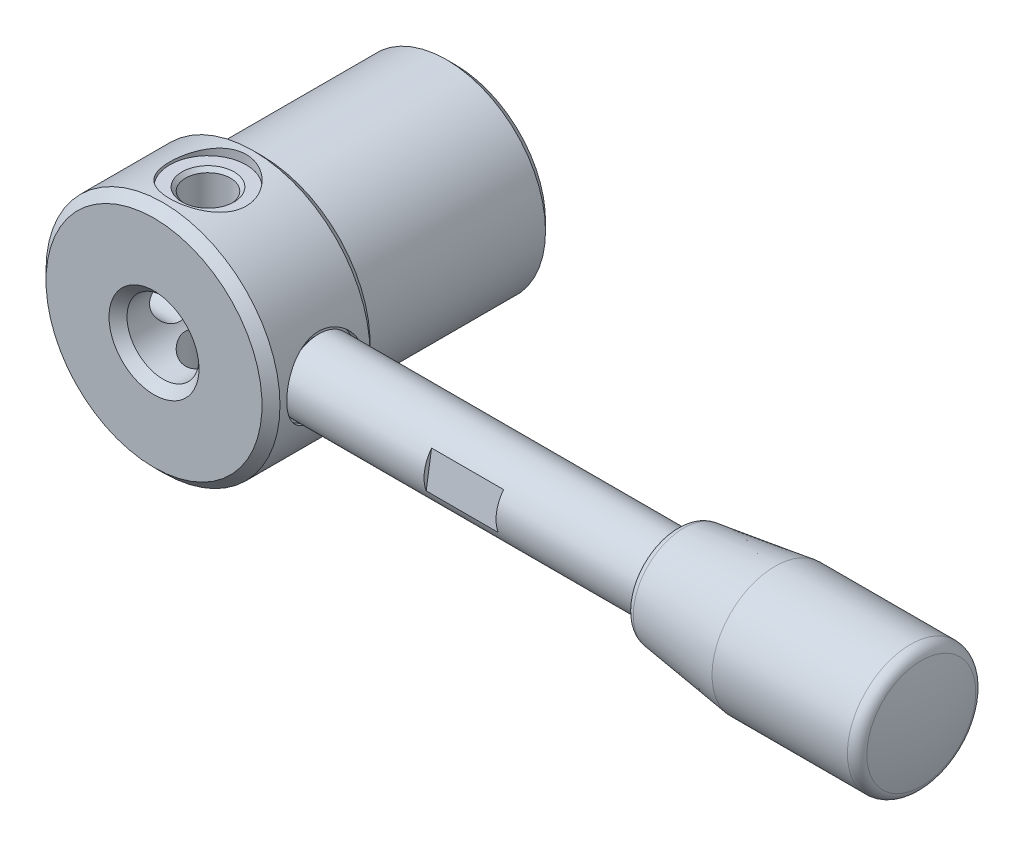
ISO-10303-21;
HEADER;
FILE_DESCRIPTION(('STEP AP214'),'2;1');
FILE_NAME('part.step','',(''),(''),'','','');
FILE_SCHEMA(('AUTOMOTIVE_DESIGN { 1 0 10303 214 1 1 1 1 }'));
ENDSEC;
DATA;
#1=APPLICATION_CONTEXT('core data for automotive mechanical design processes');
#2=APPLICATION_PROTOCOL_DEFINITION('international standard','automotive_design',2000,#1);
#3=PRODUCT_CONTEXT('',#1,'mechanical');
#4=PRODUCT('Part','Part','',(#3));
#5=PRODUCT_RELATED_PRODUCT_CATEGORY('part','',(#4));
#6=PRODUCT_DEFINITION_FORMATION('','',#4);
#7=PRODUCT_DEFINITION_CONTEXT('part definition',#1,'design');
#8=PRODUCT_DEFINITION('design','',#6,#7);
#9=PRODUCT_DEFINITION_SHAPE('','',#8);
#10=(LENGTH_UNIT() NAMED_UNIT(*) SI_UNIT(.MILLI.,.METRE.));
#11=(NAMED_UNIT(*) PLANE_ANGLE_UNIT() SI_UNIT($,.RADIAN.));
#12=(NAMED_UNIT(*) SI_UNIT($,.STERADIAN.) SOLID_ANGLE_UNIT());
#13=UNCERTAINTY_MEASURE_WITH_UNIT(LENGTH_MEASURE(1.E-05),#10,'distance_accuracy_value','');
#14=(GEOMETRIC_REPRESENTATION_CONTEXT(3) GLOBAL_UNCERTAINTY_ASSIGNED_CONTEXT((#13)) GLOBAL_UNIT_ASSIGNED_CONTEXT((#10,
#11,#12)) REPRESENTATION_CONTEXT('',''));
#15=CARTESIAN_POINT('',(0.,0.,0.));
#16=DIRECTION('',(0.,0.,1.));
#17=DIRECTION('',(1.,0.,0.));
#18=AXIS2_PLACEMENT_3D('',#15,#16,#17);
#19=CARTESIAN_POINT('',(54.9999750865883,-0.000111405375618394,6.00012811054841));
#20=DIRECTION('',(0.,-0.754591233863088,-0.656195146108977));
#21=DIRECTION('',(0.,-0.656195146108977,0.754591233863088));
#22=AXIS2_PLACEMENT_3D('',#19,#20,#21);
#23=CIRCLE('',#22,25.0000013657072);
#24=TRIMMED_CURVE('',#23,(PARAMETER_VALUE(-1.57080311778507)),
(PARAMETER_VALUE(1.57080311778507)),.T.,.PARAMETER.);
#25=CARTESIAN_POINT('',(54.9999750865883,2.48065457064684E-13,6.));
#26=DIRECTION('',(-1.,0.,0.));
#27=AXIS1_PLACEMENT('',#25,#26);
#28=SURFACE_OF_REVOLUTION('',#24,#27);
#29=CARTESIAN_POINT('',(79.2562672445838,2.30718222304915E-13,6.));
#30=DIRECTION('',(-1.,0.,0.));
#31=DIRECTION('',(0.,-0.656195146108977,0.754591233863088));
#32=AXIS2_PLACEMENT_3D('',#29,#30,#31);
#33=CIRCLE('',#32,6.05263696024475);
#34=CARTESIAN_POINT('',(79.2562672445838,-3.97171099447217,10.5672667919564));
#35=VERTEX_POINT('',#34);
#36=EDGE_CURVE('E318',#35,#35,#33,.T.);
#37=ORIENTED_EDGE('',*,*,#36,.F.);
#38=EDGE_LOOP('',(#37));
#39=FACE_BOUND('',#38,.T.);
#40=CARTESIAN_POINT('',(79.9999778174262,3.2092384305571E-13,6.));
#41=VERTEX_POINT('',#40);
#42=VERTEX_LOOP('',#41);
#43=FACE_BOUND('',#42,.T.);
#44=ADVANCED_FACE('F14',(#39,#43),#28,.T.);
#45=CARTESIAN_POINT('',(78.0434546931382,2.23779328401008E-13,6.));
#46=DIRECTION('',(-1.,0.,0.));
#47=DIRECTION('',(0.,-0.656195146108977,0.754591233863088));
#48=AXIS2_PLACEMENT_3D('',#45,#46,#47);
#49=TOROIDAL_SURFACE('',#48,5.75000000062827,1.25000000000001);
#50=CARTESIAN_POINT('',(78.0434150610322,2.23779328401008E-13,6.));
#51=DIRECTION('',(-1.,0.,0.));
#52=DIRECTION('',(0.,-0.656195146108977,0.754591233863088));
#53=AXIS2_PLACEMENT_3D('',#50,#51,#52);
#54=CIRCLE('',#53,7.);
#55=CARTESIAN_POINT('',(78.0434150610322,-4.59336602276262,11.2821386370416));
#56=VERTEX_POINT('',#55);
#57=EDGE_CURVE('E626',#56,#56,#54,.T.);
#58=ORIENTED_EDGE('',*,*,#57,.F.);
#59=EDGE_LOOP('',(#58));
#60=FACE_BOUND('',#59,.T.);
#61=ORIENTED_EDGE('',*,*,#36,.T.);
#62=EDGE_LOOP('',(#61));
#63=FACE_BOUND('',#62,.T.);
#64=ADVANCED_FACE('F66',(#60,#63),#49,.T.);
#65=CARTESIAN_POINT('',(49.4999778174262,2.68882138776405E-13,6.));
#66=DIRECTION('',(-1.,0.,0.));
#67=DIRECTION('',(0.,-0.656195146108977,0.754591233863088));
#68=AXIS2_PLACEMENT_3D('',#65,#66,#67);
#69=CYLINDRICAL_SURFACE('',#68,7.);
#70=ORIENTED_EDGE('',*,*,#57,.T.);
#71=EDGE_LOOP('',(#70));
#72=FACE_BOUND('',#71,.T.);
#73=CARTESIAN_POINT('',(62.9999778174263,2.9316826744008E-13,6.));
#74=DIRECTION('',(-1.,0.,0.));
#75=DIRECTION('',(0.,-0.656195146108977,0.754591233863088));
#76=AXIS2_PLACEMENT_3D('',#73,#74,#75);
#77=CIRCLE('',#76,7.);
#78=CARTESIAN_POINT('',(62.9999778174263,-4.59336602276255,11.2821386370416));
#79=VERTEX_POINT('',#78);
#80=EDGE_CURVE('E629',#79,#79,#77,.T.);
#81=ORIENTED_EDGE('',*,*,#80,.F.);
#82=EDGE_LOOP('',(#81));
#83=FACE_BOUND('',#82,.T.);
#84=ADVANCED_FACE('F75',(#72,#83),#69,.T.);
#85=CARTESIAN_POINT('',(52.8648931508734,2.30718222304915E-13,6.));
#86=DIRECTION('',(1.,0.,0.));
#87=DIRECTION('',(0.,0.656195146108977,-0.754591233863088));
#88=AXIS2_PLACEMENT_3D('',#85,#86,#87);
#89=CONICAL_SURFACE('',#88,5.61794300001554,0.135527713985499);
#90=ORIENTED_EDGE('',*,*,#80,.T.);
#91=EDGE_LOOP('',(#90));
#92=FACE_BOUND('',#91,.T.);
#93=CARTESIAN_POINT('',(52.8648931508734,2.30718222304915E-13,6.));
#94=DIRECTION('',(-1.,0.,0.));
#95=DIRECTION('',(0.,-0.656195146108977,0.754591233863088));
#96=AXIS2_PLACEMENT_3D('',#93,#94,#95);
#97=CIRCLE('',#96,5.61794300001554);
#98=CARTESIAN_POINT('',(52.8648931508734,-3.68646692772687,10.2392505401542));
#99=VERTEX_POINT('',#98);
#100=EDGE_CURVE('E630',#99,#99,#97,.T.);
#101=ORIENTED_EDGE('',*,*,#100,.F.);
#102=EDGE_LOOP('',(#101));
#103=FACE_BOUND('',#102,.T.);
#104=ADVANCED_FACE('F581',(#92,#103),#89,.T.);
#105=CARTESIAN_POINT('',(53.0000063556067,2.48065457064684E-13,6.));
#106=DIRECTION('',(-1.,0.,0.));
#107=DIRECTION('',(0.,-0.656195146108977,0.754591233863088));
#108=AXIS2_PLACEMENT_3D('',#105,#106,#107);
#109=TOROIDAL_SURFACE('',#108,4.62711283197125,1.);
#110=CARTESIAN_POINT('',(52.0000063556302,2.65412691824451E-13,6.));
#111=DIRECTION('',(-1.,0.,0.));
#112=DIRECTION('',(0.,-0.656195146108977,0.754591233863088));
#113=AXIS2_PLACEMENT_3D('',#110,#111,#112);
#114=CIRCLE('',#113,4.62711968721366);
#115=CARTESIAN_POINT('',(52.0000063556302,-3.03629347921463,9.49158395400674));
#116=VERTEX_POINT('',#115);
#117=EDGE_CURVE('E300',#116,#116,#114,.T.);
#118=ORIENTED_EDGE('',*,*,#117,.F.);
#119=EDGE_LOOP('',(#118));
#120=FACE_BOUND('',#119,.T.);
#121=ORIENTED_EDGE('',*,*,#100,.T.);
#122=EDGE_LOOP('',(#121));
#123=FACE_BOUND('',#122,.T.);
#124=ADVANCED_FACE('F573',(#120,#123),#109,.T.);
#125=CARTESIAN_POINT('',(51.9999934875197,2.65412691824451E-13,6.));
#126=DIRECTION('',(1.,0.,0.));
#127=DIRECTION('',(0.,0.656195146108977,-0.754591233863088));
#128=AXIS2_PLACEMENT_3D('',#125,#126,#127);
#129=CONICAL_SURFACE('',#128,2.75,1.57078947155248);
#130=CARTESIAN_POINT('',(52.,0.,6.));
#131=DIRECTION('',(-1.,0.,0.));
#132=DIRECTION('',(0.,0.154996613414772,0.987915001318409));
#133=AXIS2_PLACEMENT_3D('',#130,#131,#132);
#134=CIRCLE('',#133,3.7);
#135=CARTESIAN_POINT('',(52.,0.57348746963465,9.65528550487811));
#136=VERTEX_POINT('',#135);
#137=EDGE_CURVE('E637',#136,#136,#134,.F.);
#138=ORIENTED_EDGE('',*,*,#137,.T.);
#139=EDGE_LOOP('',(#138));
#140=FACE_BOUND('',#139,.T.);
#141=ORIENTED_EDGE('',*,*,#117,.T.);
#142=EDGE_LOOP('',(#141));
#143=FACE_BOUND('',#142,.T.);
#144=ADVANCED_FACE('F310',(#140,#143),#129,.T.);
#145=CARTESIAN_POINT('',(36.,1.43334185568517,2.23230426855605));
#146=DIRECTION('',(-1.,0.,0.));
#147=DIRECTION('',(0.,0.154996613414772,0.987915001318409));
#148=AXIS2_PLACEMENT_3D('',#145,#146,#147);
#149=PLANE('',#148);
#150=DIRECTION('',(0.,0.987915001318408,-0.154996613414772));
#151=VECTOR('',#150,1.);
#152=CARTESIAN_POINT('',(36.,1.43334185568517,2.23230426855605));
#153=LINE('',#152,#151);
#154=CARTESIAN_POINT('',(36.,-2.45557732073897,2.84244714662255));
#155=VERTEX_POINT('',#154);
#156=CARTESIAN_POINT('',(36.,1.37060102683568,2.2421478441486));
#157=VERTEX_POINT('',#156);
#158=EDGE_CURVE('E37',#155,#157,#153,.T.);
#159=ORIENTED_EDGE('',*,*,#158,.T.);
#160=CARTESIAN_POINT('',(36.,0.,6.));
#161=DIRECTION('',(-1.,0.,0.));
#162=DIRECTION('',(0.,0.154996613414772,0.987915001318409));
#163=AXIS2_PLACEMENT_3D('',#160,#161,#162);
#164=CIRCLE('',#163,4.);
#165=EDGE_CURVE('E648',#157,#155,#164,.T.);
#166=ORIENTED_EDGE('',*,*,#165,.T.);
#167=EDGE_LOOP('',(#159,#166));
#168=FACE_BOUND('',#167,.T.);
#169=ADVANCED_FACE('F557',(#168),#149,.T.);
#170=CARTESIAN_POINT('',(28.,1.43334185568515,2.23230426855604));
#171=DIRECTION('',(1.,0.,0.));
#172=DIRECTION('',(0.,-0.154996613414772,-0.987915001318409));
#173=AXIS2_PLACEMENT_3D('',#170,#171,#172);
#174=PLANE('',#173);
#175=CARTESIAN_POINT('',(28.,0.,6.));
#176=DIRECTION('',(1.,0.,0.));
#177=DIRECTION('',(0.,-0.154996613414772,-0.987915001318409));
#178=AXIS2_PLACEMENT_3D('',#175,#176,#177);
#179=CIRCLE('',#178,4.);
#180=CARTESIAN_POINT('',(28.,-2.45557732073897,2.84244714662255));
#181=VERTEX_POINT('',#180);
#182=CARTESIAN_POINT('',(28.,1.37060102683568,2.24214784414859));
#183=VERTEX_POINT('',#182);
#184=EDGE_CURVE('E61',#181,#183,#179,.T.);
#185=ORIENTED_EDGE('',*,*,#184,.T.);
#186=DIRECTION('',(0.,-0.987915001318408,0.154996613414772));
#187=VECTOR('',#186,1.);
#188=CARTESIAN_POINT('',(28.,1.43334185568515,2.23230426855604));
#189=LINE('',#188,#187);
#190=EDGE_CURVE('E672',#183,#181,#189,.T.);
#191=ORIENTED_EDGE('',*,*,#190,.T.);
#192=EDGE_LOOP('',(#185,#191));
#193=FACE_BOUND('',#192,.T.);
#194=ADVANCED_FACE('F549',(#193),#174,.T.);
#195=CARTESIAN_POINT('',(28.,-2.51831814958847,2.85229072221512));
#196=DIRECTION('',(0.,-0.154996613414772,-0.987915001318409));
#197=DIRECTION('',(1.,0.,0.));
#198=AXIS2_PLACEMENT_3D('',#195,#196,#197);
#199=PLANE('',#198);
#200=DIRECTION('',(1.,0.,0.));
#201=VECTOR('',#200,1.);
#202=CARTESIAN_POINT('',(12.,1.37060102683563,2.2421478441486));
#203=LINE('',#202,#201);
#204=EDGE_CURVE('E643',#183,#157,#203,.T.);
#205=ORIENTED_EDGE('',*,*,#204,.T.);
#206=ORIENTED_EDGE('',*,*,#158,.F.);
#207=DIRECTION('',(1.,0.,0.));
#208=VECTOR('',#207,1.);
#209=CARTESIAN_POINT('',(12.,-2.45557732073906,2.84244714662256));
#210=LINE('',#209,#208);
#211=EDGE_CURVE('E645',#155,#181,#210,.F.);
#212=ORIENTED_EDGE('',*,*,#211,.T.);
#213=ORIENTED_EDGE('',*,*,#190,.F.);
#214=EDGE_LOOP('',(#205,#206,#212,#213));
#215=FACE_BOUND('',#214,.T.);
#216=ADVANCED_FACE('F540',(#215),#199,.T.);
#217=CARTESIAN_POINT('',(36.,2.51831814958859,9.14770927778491));
#218=DIRECTION('',(1.,0.,0.));
#219=DIRECTION('',(0.,-0.154996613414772,-0.987915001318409));
#220=AXIS2_PLACEMENT_3D('',#217,#218,#219);
#221=PLANE('',#220);
#222=DIRECTION('',(0.,0.987915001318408,-0.154996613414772));
#223=VECTOR('',#222,1.);
#224=CARTESIAN_POINT('',(36.,2.51831814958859,9.14770927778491));
#225=LINE('',#224,#223);
#226=CARTESIAN_POINT('',(36.,-1.37060102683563,9.75785215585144));
#227=VERTEX_POINT('',#226);
#228=CARTESIAN_POINT('',(36.,2.45557732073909,9.15755285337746));
#229=VERTEX_POINT('',#228);
#230=EDGE_CURVE('E665',#227,#229,#225,.T.);
#231=ORIENTED_EDGE('',*,*,#230,.F.);
#232=CARTESIAN_POINT('',(36.,0.,6.));
#233=DIRECTION('',(1.,0.,0.));
#234=DIRECTION('',(0.,-0.154996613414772,-0.987915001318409));
#235=AXIS2_PLACEMENT_3D('',#232,#233,#234);
#236=CIRCLE('',#235,4.);
#237=EDGE_CURVE('E657',#229,#227,#236,.T.);
#238=ORIENTED_EDGE('',*,*,#237,.F.);
#239=EDGE_LOOP('',(#231,#238));
#240=FACE_BOUND('',#239,.T.);
#241=ADVANCED_FACE('F531',(#240),#221,.F.);
#242=CARTESIAN_POINT('',(28.,-1.43334185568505,9.76769573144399));
#243=DIRECTION('',(0.,0.154996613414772,0.987915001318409));
#244=DIRECTION('',(1.,0.,0.));
#245=AXIS2_PLACEMENT_3D('',#242,#243,#244);
#246=PLANE('',#245);
#247=DIRECTION('',(1.,0.,0.));
#248=VECTOR('',#247,1.);
#249=CARTESIAN_POINT('',(12.,-1.37060102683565,9.75785215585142));
#250=LINE('',#249,#248);
#251=CARTESIAN_POINT('',(28.,-1.37060102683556,9.75785215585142));
#252=VERTEX_POINT('',#251);
#253=EDGE_CURVE('E653',#252,#227,#250,.T.);
#254=ORIENTED_EDGE('',*,*,#253,.T.);
#255=ORIENTED_EDGE('',*,*,#230,.T.);
#256=DIRECTION('',(1.,0.,0.));
#257=VECTOR('',#256,1.);
#258=CARTESIAN_POINT('',(12.,2.45557732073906,9.15755285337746));
#259=LINE('',#258,#257);
#260=CARTESIAN_POINT('',(28.,2.45557732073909,9.15755285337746));
#261=VERTEX_POINT('',#260);
#262=EDGE_CURVE('E650',#229,#261,#259,.F.);
#263=ORIENTED_EDGE('',*,*,#262,.T.);
#264=DIRECTION('',(0.,-0.987915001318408,0.154996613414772));
#265=VECTOR('',#264,1.);
#266=CARTESIAN_POINT('',(28.,2.51831814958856,9.1477092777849));
#267=LINE('',#266,#265);
#268=EDGE_CURVE('E668',#261,#252,#267,.T.);
#269=ORIENTED_EDGE('',*,*,#268,.T.);
#270=EDGE_LOOP('',(#254,#255,#263,#269));
#271=FACE_BOUND('',#270,.T.);
#272=ADVANCED_FACE('F522',(#271),#246,.T.);
#273=CARTESIAN_POINT('',(28.,2.51831814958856,9.1477092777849));
#274=DIRECTION('',(-1.,0.,0.));
#275=DIRECTION('',(0.,0.154996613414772,0.987915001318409));
#276=AXIS2_PLACEMENT_3D('',#273,#274,#275);
#277=PLANE('',#276);
#278=CARTESIAN_POINT('',(28.,0.,6.));
#279=DIRECTION('',(-1.,0.,0.));
#280=DIRECTION('',(0.,0.154996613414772,0.987915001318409));
#281=AXIS2_PLACEMENT_3D('',#278,#279,#280);
#282=CIRCLE('',#281,4.);
#283=EDGE_CURVE('E655',#252,#261,#282,.T.);
#284=ORIENTED_EDGE('',*,*,#283,.F.);
#285=ORIENTED_EDGE('',*,*,#268,.F.);
#286=EDGE_LOOP('',(#284,#285));
#287=FACE_BOUND('',#286,.T.);
#288=ADVANCED_FACE('F513',(#287),#277,.F.);
#289=CARTESIAN_POINT('',(51.7,0.,6.));
#290=DIRECTION('',(-1.,0.,0.));
#291=DIRECTION('',(0.,0.154996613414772,0.987915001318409));
#292=AXIS2_PLACEMENT_3D('',#289,#290,#291);
#293=CONICAL_SURFACE('',#292,4.,0.785398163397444);
#294=ORIENTED_EDGE('',*,*,#137,.F.);
#295=EDGE_LOOP('',(#294));
#296=FACE_BOUND('',#295,.T.);
#297=CARTESIAN_POINT('',(51.7,0.,6.));
#298=DIRECTION('',(-1.,0.,0.));
#299=DIRECTION('',(0.,0.154996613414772,0.987915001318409));
#300=AXIS2_PLACEMENT_3D('',#297,#298,#299);
#301=CIRCLE('',#300,4.);
#302=CARTESIAN_POINT('',(51.7,0.619986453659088,9.95166000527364));
#303=VERTEX_POINT('',#302);
#304=EDGE_CURVE('E640',#303,#303,#301,.T.);
#305=ORIENTED_EDGE('',*,*,#304,.F.);
#306=EDGE_LOOP('',(#305));
#307=FACE_BOUND('',#306,.T.);
#308=ADVANCED_FACE('F504',(#296,#307),#293,.T.);
#309=CARTESIAN_POINT('',(12.,0.,6.));
#310=DIRECTION('',(1.,0.,0.));
#311=DIRECTION('',(0.,-0.154996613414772,-0.987915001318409));
#312=AXIS2_PLACEMENT_3D('',#309,#310,#311);
#313=CYLINDRICAL_SURFACE('',#312,4.);
#314=ORIENTED_EDGE('',*,*,#304,.T.);
#315=EDGE_LOOP('',(#314));
#316=FACE_BOUND('',#315,.T.);
#317=ORIENTED_EDGE('',*,*,#283,.T.);
#318=ORIENTED_EDGE('',*,*,#262,.F.);
#319=ORIENTED_EDGE('',*,*,#237,.T.);
#320=ORIENTED_EDGE('',*,*,#253,.F.);
#321=EDGE_LOOP('',(#317,#318,#319,#320));
#322=FACE_BOUND('',#321,.T.);
#323=CARTESIAN_POINT('',(12.3,0.,6.));
#324=DIRECTION('',(-1.,0.,0.));
#325=DIRECTION('',(0.,0.154996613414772,0.987915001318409));
#326=AXIS2_PLACEMENT_3D('',#323,#324,#325);
#327=CIRCLE('',#326,4.);
#328=CARTESIAN_POINT('',(12.3,0.619986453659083,9.95166000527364));
#329=VERTEX_POINT('',#328);
#330=EDGE_CURVE('E660',#329,#329,#327,.F.);
#331=ORIENTED_EDGE('',*,*,#330,.T.);
#332=EDGE_LOOP('',(#331));
#333=FACE_BOUND('',#332,.T.);
#334=ORIENTED_EDGE('',*,*,#204,.F.);
#335=ORIENTED_EDGE('',*,*,#184,.F.);
#336=ORIENTED_EDGE('',*,*,#211,.F.);
#337=ORIENTED_EDGE('',*,*,#165,.F.);
#338=EDGE_LOOP('',(#334,#335,#336,#337));
#339=FACE_BOUND('',#338,.T.);
#340=ADVANCED_FACE('F495',(#316,#322,#333,#339),#313,.T.);
#341=CARTESIAN_POINT('',(12.,0.,6.));
#342=DIRECTION('',(1.,0.,0.));
#343=DIRECTION('',(0.,-0.154996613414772,-0.987915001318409));
#344=AXIS2_PLACEMENT_3D('',#341,#342,#343);
#345=CONICAL_SURFACE('',#344,3.7,0.785398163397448);
#346=ORIENTED_EDGE('',*,*,#330,.F.);
#347=EDGE_LOOP('',(#346));
#348=FACE_BOUND('',#347,.T.);
#349=CARTESIAN_POINT('',(12.,0.,6.));
#350=DIRECTION('',(-1.,0.,0.));
#351=DIRECTION('',(0.,0.154996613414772,0.987915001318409));
#352=AXIS2_PLACEMENT_3D('',#349,#350,#351);
#353=CIRCLE('',#352,3.7);
#354=CARTESIAN_POINT('',(12.,0.573487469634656,9.65528550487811));
#355=VERTEX_POINT('',#354);
#356=EDGE_CURVE('E663',#355,#355,#353,.T.);
#357=ORIENTED_EDGE('',*,*,#356,.F.);
#358=EDGE_LOOP('',(#357));
#359=FACE_BOUND('',#358,.T.);
#360=ADVANCED_FACE('F487',(#348,#359),#345,.T.);
#361=CARTESIAN_POINT('',(7.,0.,6.));
#362=DIRECTION('',(-1.,0.,0.));
#363=DIRECTION('',(0.,0.701415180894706,0.71275293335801));
#364=AXIS2_PLACEMENT_3D('',#361,#362,#363);
#365=PLANE('',#364);
#366=CARTESIAN_POINT('',(7.,0.,6.));
#367=DIRECTION('',(-1.,0.,0.));
#368=DIRECTION('',(0.,0.701415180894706,0.71275293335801));
#369=AXIS2_PLACEMENT_3D('',#366,#367,#368);
#370=CIRCLE('',#369,1.7);
#371=CARTESIAN_POINT('',(7.,1.19240580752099,7.21167998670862));
#372=VERTEX_POINT('',#371);
#373=EDGE_CURVE('E29',#372,#372,#370,.T.);
#374=ORIENTED_EDGE('',*,*,#373,.T.);
#375=EDGE_LOOP('',(#374));
#376=FACE_BOUND('',#375,.T.);
#377=ADVANCED_FACE('F102',(#376),#365,.T.);
#378=CARTESIAN_POINT('',(7.,0.,6.));
#379=DIRECTION('',(1.,0.,0.));
#380=DIRECTION('',(0.,-0.701415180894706,-0.71275293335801));
#381=AXIS2_PLACEMENT_3D('',#378,#379,#380);
#382=CONICAL_SURFACE('',#381,1.7,0.785398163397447);
#383=CARTESIAN_POINT('',(7.8,0.,6.));
#384=DIRECTION('',(-1.,0.,0.));
#385=DIRECTION('',(0.,0.701415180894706,0.71275293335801));
#386=AXIS2_PLACEMENT_3D('',#383,#384,#385);
#387=CIRCLE('',#386,2.5);
#388=CARTESIAN_POINT('',(7.8,1.75353795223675,7.78188233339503));
#389=VERTEX_POINT('',#388);
#390=EDGE_CURVE('E9',#389,#389,#387,.F.);
#391=ORIENTED_EDGE('',*,*,#390,.F.);
#392=EDGE_LOOP('',(#391));
#393=FACE_BOUND('',#392,.T.);
#394=ORIENTED_EDGE('',*,*,#373,.F.);
#395=EDGE_LOOP('',(#394));
#396=FACE_BOUND('',#395,.T.);
#397=ADVANCED_FACE('F88',(#393,#396),#382,.T.);
#398=CARTESIAN_POINT('',(0.,0.,-21.5));
#399=DIRECTION('',(0.,0.,-1.));
#400=DIRECTION('',(0.,-1.,0.));
#401=AXIS2_PLACEMENT_3D('',#398,#399,#400);
#402=CYLINDRICAL_SURFACE('',#401,11.);
#403=CARTESIAN_POINT('',(0.,0.,-20.5));
#404=DIRECTION('',(0.,0.,1.));
#405=DIRECTION('',(0.,1.,0.));
#406=AXIS2_PLACEMENT_3D('',#403,#404,#405);
#407=CIRCLE('',#406,11.);
#408=CARTESIAN_POINT('',(0.,11.,-20.5));
#409=VERTEX_POINT('',#408);
#410=EDGE_CURVE('E225',#409,#409,#407,.T.);
#411=ORIENTED_EDGE('',*,*,#410,.T.);
#412=EDGE_LOOP('',(#411));
#413=FACE_BOUND('',#412,.T.);
#414=CARTESIAN_POINT('',(0.,0.,0.));
#415=DIRECTION('',(0.,0.,-1.));
#416=DIRECTION('',(0.,-1.,0.));
#417=AXIS2_PLACEMENT_3D('',#414,#415,#416);
#418=CIRCLE('',#417,11.);
#419=CARTESIAN_POINT('',(0.,-11.,0.));
#420=VERTEX_POINT('',#419);
#421=EDGE_CURVE('E352',#420,#420,#418,.T.);
#422=ORIENTED_EDGE('',*,*,#421,.T.);
#423=EDGE_LOOP('',(#422));
#424=FACE_BOUND('',#423,.T.);
#425=ADVANCED_FACE('F85',(#413,#424),#402,.T.);
#426=CARTESIAN_POINT('',(0.,0.,-21.5));
#427=DIRECTION('',(0.,0.,1.));
#428=DIRECTION('',(0.,1.,0.));
#429=AXIS2_PLACEMENT_3D('',#426,#427,#428);
#430=CONICAL_SURFACE('',#429,10.,0.785398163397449);
#431=ORIENTED_EDGE('',*,*,#410,.F.);
#432=EDGE_LOOP('',(#431));
#433=FACE_BOUND('',#432,.T.);
#434=CARTESIAN_POINT('',(0.,0.,-21.5));
#435=DIRECTION('',(0.,0.,1.));
#436=DIRECTION('',(0.,1.,0.));
#437=AXIS2_PLACEMENT_3D('',#434,#435,#436);
#438=CIRCLE('',#437,10.);
#439=CARTESIAN_POINT('',(0.,10.,-21.5));
#440=VERTEX_POINT('',#439);
#441=EDGE_CURVE('E229',#440,#440,#438,.F.);
#442=ORIENTED_EDGE('',*,*,#441,.F.);
#443=EDGE_LOOP('',(#442));
#444=FACE_BOUND('',#443,.T.);
#445=ADVANCED_FACE('F87',(#433,#444),#430,.T.);
#446=CARTESIAN_POINT('',(-4.,0.,12.));
#447=DIRECTION('',(0.,0.,-1.));
#448=DIRECTION('',(0.,-1.,0.));
#449=AXIS2_PLACEMENT_3D('',#446,#447,#448);
#450=PLANE('',#449);
#451=CARTESIAN_POINT('',(0.,0.,12.));
#452=DIRECTION('',(0.,0.,-1.));
#453=DIRECTION('',(0.,-1.,0.));
#454=AXIS2_PLACEMENT_3D('',#451,#452,#453);
#455=CIRCLE('',#454,5.);
#456=CARTESIAN_POINT('',(0.,-5.,12.));
#457=VERTEX_POINT('',#456);
#458=EDGE_CURVE('E299',#457,#457,#455,.T.);
#459=ORIENTED_EDGE('',*,*,#458,.T.);
#460=EDGE_LOOP('',(#459));
#461=FACE_BOUND('',#460,.T.);
#462=CARTESIAN_POINT('',(0.,0.,12.));
#463=DIRECTION('',(0.,0.,-1.));
#464=DIRECTION('',(0.,-1.,0.));
#465=AXIS2_PLACEMENT_3D('',#462,#463,#464);
#466=CIRCLE('',#465,12.);
#467=CARTESIAN_POINT('',(0.,-12.,12.));
#468=VERTEX_POINT('',#467);
#469=EDGE_CURVE('E233',#468,#468,#466,.F.);
#470=ORIENTED_EDGE('',*,*,#469,.T.);
#471=EDGE_LOOP('',(#470));
#472=FACE_BOUND('',#471,.T.);
#473=ADVANCED_FACE('F97',(#461,#472),#450,.F.);
#474=CARTESIAN_POINT('',(-4.,0.,-21.5));
#475=DIRECTION('',(0.,0.,1.));
#476=DIRECTION('',(0.,1.,0.));
#477=AXIS2_PLACEMENT_3D('',#474,#475,#476);
#478=PLANE('',#477);
#479=CARTESIAN_POINT('',(0.,0.,-21.5));
#480=DIRECTION('',(0.,0.,1.));
#481=DIRECTION('',(0.,1.,0.));
#482=AXIS2_PLACEMENT_3D('',#479,#480,#481);
#483=CIRCLE('',#482,5.);
#484=CARTESIAN_POINT('',(0.,5.,-21.5));
#485=VERTEX_POINT('',#484);
#486=EDGE_CURVE('E294',#485,#485,#483,.T.);
#487=ORIENTED_EDGE('',*,*,#486,.T.);
#488=EDGE_LOOP('',(#487));
#489=FACE_BOUND('',#488,.T.);
#490=ORIENTED_EDGE('',*,*,#441,.T.);
#491=EDGE_LOOP('',(#490));
#492=FACE_BOUND('',#491,.T.);
#493=ADVANCED_FACE('F204',(#489,#492),#478,.F.);
#494=CARTESIAN_POINT('',(0.,12.,6.));
#495=DIRECTION('',(0.,1.,0.));
#496=DIRECTION('',(-1.,0.,0.));
#497=AXIS2_PLACEMENT_3D('',#494,#495,#496);
#498=CONICAL_SURFACE('',#497,2.9,0.785398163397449);
#499=CARTESIAN_POINT('',(0.,11.6,6.));
#500=DIRECTION('',(0.,1.,0.));
#501=DIRECTION('',(-1.,0.,0.));
#502=AXIS2_PLACEMENT_3D('',#499,#500,#501);
#503=CIRCLE('',#502,2.5);
#504=CARTESIAN_POINT('',(-2.50000000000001,11.6,6.));
#505=VERTEX_POINT('',#504);
#506=EDGE_CURVE('E324',#505,#505,#503,.F.);
#507=ORIENTED_EDGE('',*,*,#506,.T.);
#508=EDGE_LOOP('',(#507));
#509=FACE_BOUND('',#508,.T.);
#510=CARTESIAN_POINT('',(0.,12.,6.));
#511=DIRECTION('',(0.,1.,0.));
#512=DIRECTION('',(-1.,0.,0.));
#513=AXIS2_PLACEMENT_3D('',#510,#511,#512);
#514=CIRCLE('',#513,2.9);
#515=CARTESIAN_POINT('',(-2.9,12.,6.));
#516=VERTEX_POINT('',#515);
#517=EDGE_CURVE('E339',#516,#516,#514,.T.);
#518=ORIENTED_EDGE('',*,*,#517,.T.);
#519=EDGE_LOOP('',(#518));
#520=FACE_BOUND('',#519,.T.);
#521=ADVANCED_FACE('F100',(#509,#520),#498,.F.);
#522=CARTESIAN_POINT('',(1.35308431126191E-13,-12.,6.));
#523=DIRECTION('',(0.,-1.,0.));
#524=DIRECTION('',(1.,0.,0.));
#525=AXIS2_PLACEMENT_3D('',#522,#523,#524);
#526=CONICAL_SURFACE('',#525,2.9,0.785398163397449);
#527=CARTESIAN_POINT('',(1.31838984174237E-13,-11.6,6.));
#528=DIRECTION('',(0.,-1.,0.));
#529=DIRECTION('',(1.,0.,0.));
#530=AXIS2_PLACEMENT_3D('',#527,#528,#529);
#531=CIRCLE('',#530,2.5);
#532=CARTESIAN_POINT('',(2.50000000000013,-11.6,6.));
#533=VERTEX_POINT('',#532);
#534=EDGE_CURVE('E322',#533,#533,#531,.F.);
#535=ORIENTED_EDGE('',*,*,#534,.T.);
#536=EDGE_LOOP('',(#535));
#537=FACE_BOUND('',#536,.T.);
#538=CARTESIAN_POINT('',(1.35308431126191E-13,-12.,6.));
#539=DIRECTION('',(0.,-1.,0.));
#540=DIRECTION('',(1.,0.,0.));
#541=AXIS2_PLACEMENT_3D('',#538,#539,#540);
#542=CIRCLE('',#541,2.9);
#543=CARTESIAN_POINT('',(2.90000000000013,-12.,6.));
#544=VERTEX_POINT('',#543);
#545=EDGE_CURVE('E333',#544,#544,#542,.T.);
#546=ORIENTED_EDGE('',*,*,#545,.T.);
#547=EDGE_LOOP('',(#546));
#548=FACE_BOUND('',#547,.T.);
#549=ADVANCED_FACE('F251',(#537,#548),#526,.F.);
#550=CARTESIAN_POINT('',(-12.,0.,6.));
#551=DIRECTION('',(-1.,0.,0.));
#552=DIRECTION('',(0.,-1.,0.));
#553=AXIS2_PLACEMENT_3D('',#550,#551,#552);
#554=CONICAL_SURFACE('',#553,2.9,0.785398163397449);
#555=CARTESIAN_POINT('',(-11.6,0.,6.));
#556=DIRECTION('',(-1.,0.,0.));
#557=DIRECTION('',(0.,-1.,0.));
#558=AXIS2_PLACEMENT_3D('',#555,#556,#557);
#559=CIRCLE('',#558,2.5);
#560=CARTESIAN_POINT('',(-11.6,-2.50000000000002,6.));
#561=VERTEX_POINT('',#560);
#562=EDGE_CURVE('E306',#561,#561,#559,.F.);
#563=ORIENTED_EDGE('',*,*,#562,.T.);
#564=EDGE_LOOP('',(#563));
#565=FACE_BOUND('',#564,.T.);
#566=CARTESIAN_POINT('',(-12.,0.,6.));
#567=DIRECTION('',(-1.,0.,0.));
#568=DIRECTION('',(0.,-1.,0.));
#569=AXIS2_PLACEMENT_3D('',#566,#567,#568);
#570=CIRCLE('',#569,2.9);
#571=CARTESIAN_POINT('',(-12.,-2.90000000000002,6.));
#572=VERTEX_POINT('',#571);
#573=EDGE_CURVE('E336',#572,#572,#570,.T.);
#574=ORIENTED_EDGE('',*,*,#573,.T.);
#575=EDGE_LOOP('',(#574));
#576=FACE_BOUND('',#575,.T.);
#577=ADVANCED_FACE('F202',(#565,#576),#554,.F.);
#578=CARTESIAN_POINT('',(0.,0.,12.));
#579=DIRECTION('',(0.,0.,1.));
#580=DIRECTION('',(0.,1.,0.));
#581=AXIS2_PLACEMENT_3D('',#578,#579,#580);
#582=CONICAL_SURFACE('',#581,5.,0.785398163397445);
#583=CARTESIAN_POINT('',(0.,0.,11.));
#584=DIRECTION('',(0.,0.,-1.));
#585=DIRECTION('',(0.,-1.,0.));
#586=AXIS2_PLACEMENT_3D('',#583,#584,#585);
#587=CIRCLE('',#586,4.);
#588=CARTESIAN_POINT('',(0.,-4.,11.));
#589=VERTEX_POINT('',#588);
#590=EDGE_CURVE('E288',#589,#589,#587,.F.);
#591=ORIENTED_EDGE('',*,*,#590,.F.);
#592=EDGE_LOOP('',(#591));
#593=FACE_BOUND('',#592,.T.);
#594=ORIENTED_EDGE('',*,*,#458,.F.);
#595=EDGE_LOOP('',(#594));
#596=FACE_BOUND('',#595,.T.);
#597=ADVANCED_FACE('F16',(#593,#596),#582,.F.);
#598=CARTESIAN_POINT('',(0.,0.,-20.5));
#599=DIRECTION('',(0.,0.,-1.));
#600=DIRECTION('',(0.,-1.,0.));
#601=AXIS2_PLACEMENT_3D('',#598,#599,#600);
#602=CONICAL_SURFACE('',#601,4.,0.785398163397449);
#603=ORIENTED_EDGE('',*,*,#486,.F.);
#604=EDGE_LOOP('',(#603));
#605=FACE_BOUND('',#604,.T.);
#606=CARTESIAN_POINT('',(0.,0.,-20.5));
#607=DIRECTION('',(0.,0.,1.));
#608=DIRECTION('',(0.,1.,0.));
#609=AXIS2_PLACEMENT_3D('',#606,#607,#608);
#610=CIRCLE('',#609,4.);
#611=CARTESIAN_POINT('',(0.,4.,-20.5));
#612=VERTEX_POINT('',#611);
#613=EDGE_CURVE('E290',#612,#612,#610,.F.);
#614=ORIENTED_EDGE('',*,*,#613,.F.);
#615=EDGE_LOOP('',(#614));
#616=FACE_BOUND('',#615,.T.);
#617=ADVANCED_FACE('F187',(#605,#616),#602,.F.);
#618=CARTESIAN_POINT('',(0.,-17.7583302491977,6.));
#619=DIRECTION('',(0.,1.,0.));
#620=DIRECTION('',(-1.,0.,0.));
#621=AXIS2_PLACEMENT_3D('',#618,#619,#620);
#622=CYLINDRICAL_SURFACE('',#621,2.5);
#623=CARTESIAN_POINT('',(-2.5,3.12249899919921,6.));
#624=CARTESIAN_POINT('',(-2.4999994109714,3.12249991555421,6.06215675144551));
#625=CARTESIAN_POINT('',(-2.49767581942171,3.12436490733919,6.12432594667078));
#626=CARTESIAN_POINT('',(-2.48843349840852,3.13172923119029,6.24811717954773));
#627=CARTESIAN_POINT('',(-2.4815120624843,3.13723070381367,6.30973887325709));
#628=CARTESIAN_POINT('',(-2.45397595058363,3.15888953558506,6.4932260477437));
#629=CARTESIAN_POINT('',(-2.42658990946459,3.18020036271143,6.61354833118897));
#630=CARTESIAN_POINT('',(-2.35576217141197,3.23299770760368,6.84559819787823));
#631=CARTESIAN_POINT('',(-2.312459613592,3.26439575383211,6.95739041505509));
#632=CARTESIAN_POINT('',(-2.21143916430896,3.33366000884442,7.17200852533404));
#633=CARTESIAN_POINT('',(-2.15372087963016,3.37152639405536,7.27483417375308));
#634=CARTESIAN_POINT('',(-2.01647682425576,3.45559225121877,7.48373398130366));
#635=CARTESIAN_POINT('',(-1.93506425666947,3.50222814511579,7.5883933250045));
#636=CARTESIAN_POINT('',(-1.7566252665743,3.59505503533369,7.78376155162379));
#637=CARTESIAN_POINT('',(-1.65958538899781,3.6412456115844,7.87445827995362));
#638=CARTESIAN_POINT('',(-1.43833990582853,3.73459524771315,8.05022029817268));
#639=CARTESIAN_POINT('',(-1.3122693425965,3.78119887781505,8.13328618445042));
#640=CARTESIAN_POINT('',(-1.11163395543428,3.84307251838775,8.24054515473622));
#641=CARTESIAN_POINT('',(-1.04281240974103,3.86236283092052,8.2734151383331));
#642=CARTESIAN_POINT('',(-0.901758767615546,3.89770436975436,8.33295468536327));
#643=CARTESIAN_POINT('',(-0.829529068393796,3.91375783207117,8.35962853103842));
#644=CARTESIAN_POINT('',(-0.689700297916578,3.94066759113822,8.40398381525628));
#645=CARTESIAN_POINT('',(-0.62237198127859,3.95188535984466,8.4223019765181));
#646=CARTESIAN_POINT('',(-0.48599757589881,3.97096241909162,8.45330228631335));
#647=CARTESIAN_POINT('',(-0.416952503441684,3.97882364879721,8.46598768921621));
#648=CARTESIAN_POINT('',(-0.277765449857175,3.99095470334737,8.48551379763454));
#649=CARTESIAN_POINT('',(-0.207624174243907,3.99522674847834,8.49235811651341));
#650=CARTESIAN_POINT('',(-0.0669114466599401,4.00006125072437,8.50009921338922));
#651=CARTESIAN_POINT('',(0.00365995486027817,4.00062413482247,8.50099667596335));
#652=CARTESIAN_POINT('',(0.19604508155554,3.997044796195,8.49527462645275));
#653=CARTESIAN_POINT('',(0.317681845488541,3.98917040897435,8.48269349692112));
#654=CARTESIAN_POINT('',(0.556636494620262,3.96290903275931,8.44026978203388));
#655=CARTESIAN_POINT('',(0.673954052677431,3.94452124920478,8.41042589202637));
#656=CARTESIAN_POINT('',(0.901771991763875,3.89876170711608,8.33479144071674));
#657=CARTESIAN_POINT('',(1.01225407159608,3.87136697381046,8.28896008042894));
#658=CARTESIAN_POINT('',(1.22404012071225,3.80971291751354,8.18306276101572));
#659=CARTESIAN_POINT('',(1.32534199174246,3.77545203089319,8.12299355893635));
#660=CARTESIAN_POINT('',(1.5294264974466,3.69786441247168,7.98194358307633));
#661=CARTESIAN_POINT('',(1.63082454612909,3.6539400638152,7.89929072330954));
#662=CARTESIAN_POINT('',(1.81919733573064,3.56390927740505,7.71973526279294));
#663=CARTESIAN_POINT('',(1.90615071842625,3.51779973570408,7.62281195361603));
#664=CARTESIAN_POINT('',(2.0747088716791,3.42142883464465,7.40258874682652));
#665=CARTESIAN_POINT('',(2.15413229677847,3.37141162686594,7.27749723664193));
#666=CARTESIAN_POINT('',(2.29052307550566,3.28028278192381,7.0127077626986));
#667=CARTESIAN_POINT('',(2.34753179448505,3.23915480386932,6.87303731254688));
#668=CARTESIAN_POINT('',(2.42437133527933,3.18183753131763,6.62046119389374));
#669=CARTESIAN_POINT('',(2.45003683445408,3.1619340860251,6.5101780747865));
#670=CARTESIAN_POINT('',(2.48620337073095,3.13358277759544,6.2857696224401));
#671=CARTESIAN_POINT('',(2.49672512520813,3.12511926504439,6.17164975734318));
#672=CARTESIAN_POINT('',(2.50197072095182,3.12092267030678,5.94254263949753));
#673=CARTESIAN_POINT('',(2.49665835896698,3.12521876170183,5.82755399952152));
#674=CARTESIAN_POINT('',(2.47051466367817,3.14592085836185,5.60043883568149));
#675=CARTESIAN_POINT('',(2.44967047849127,3.16233689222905,5.48831476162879));
#676=CARTESIAN_POINT('',(2.39409874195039,3.20460120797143,5.27156324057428));
#677=CARTESIAN_POINT('',(2.35960571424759,3.23028954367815,5.16684268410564));
#678=CARTESIAN_POINT('',(2.27804893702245,3.28831148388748,4.96442530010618));
#679=CARTESIAN_POINT('',(2.23098072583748,3.32064744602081,4.86673098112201));
#680=CARTESIAN_POINT('',(2.11530798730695,3.39574401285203,4.66138805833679));
#681=CARTESIAN_POINT('',(2.04430931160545,3.43931724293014,4.55538547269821));
#682=CARTESIAN_POINT('',(1.88737868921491,3.52787943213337,4.35562933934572));
#683=CARTESIAN_POINT('',(1.80143124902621,3.57286982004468,4.26188867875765));
#684=CARTESIAN_POINT('',(1.60076932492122,3.66766209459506,4.07403592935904));
#685=CARTESIAN_POINT('',(1.48365201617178,3.71707933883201,3.98227260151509));
#686=CARTESIAN_POINT('',(1.2325678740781,3.80768973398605,3.81985298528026));
#687=CARTESIAN_POINT('',(1.09860897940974,3.84888673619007,3.74918680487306));
#688=CARTESIAN_POINT('',(0.891930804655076,3.89988966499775,3.663418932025));
#689=CARTESIAN_POINT('',(0.824318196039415,3.91477055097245,3.63870255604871));
#690=CARTESIAN_POINT('',(0.686640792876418,3.94124643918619,3.59506172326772));
#691=CARTESIAN_POINT('',(0.61657744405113,3.95284334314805,3.57613391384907));
#692=CARTESIAN_POINT('',(0.474639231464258,3.9723851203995,3.54439416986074));
#693=CARTESIAN_POINT('',(0.402766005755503,3.98033317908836,3.53157690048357));
#694=CARTESIAN_POINT('',(0.257881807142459,3.99234168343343,3.5122608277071));
#695=CARTESIAN_POINT('',(0.184871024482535,3.99640277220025,3.5057609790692));
#696=CARTESIAN_POINT('',(-0.0131102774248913,4.00191521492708,3.49692848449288));
#697=CARTESIAN_POINT('',(-0.13853907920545,3.99952706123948,3.50073420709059));
#698=CARTESIAN_POINT('',(-0.386583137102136,3.98321975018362,3.52691758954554));
#699=CARTESIAN_POINT('',(-0.509198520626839,3.96930111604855,3.54929440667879));
#700=CARTESIAN_POINT('',(-0.744080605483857,3.93192083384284,3.61032241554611));
#701=CARTESIAN_POINT('',(-0.856558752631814,3.90880701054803,3.64838207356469));
#702=CARTESIAN_POINT('',(-1.07343034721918,3.85489971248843,3.73911946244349));
#703=CARTESIAN_POINT('',(-1.17782242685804,3.82410494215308,3.7917996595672));
#704=CARTESIAN_POINT('',(-1.38731297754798,3.75350673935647,3.91632127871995));
#705=CARTESIAN_POINT('',(-1.49136012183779,3.71310001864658,3.98958399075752));
#706=CARTESIAN_POINT('',(-1.68643334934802,3.62867283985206,4.15015323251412));
#707=CARTESIAN_POINT('',(-1.77744451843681,3.58464833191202,4.23747560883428));
#708=CARTESIAN_POINT('',(-1.95744716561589,3.49000828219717,4.43823251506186));
#709=CARTESIAN_POINT('',(-2.04425661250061,3.43935738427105,4.55361661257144));
#710=CARTESIAN_POINT('',(-2.19754648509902,3.34349647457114,4.79928940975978));
#711=CARTESIAN_POINT('',(-2.26403815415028,3.29828346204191,4.92956981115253));
#712=CARTESIAN_POINT('',(-2.36198229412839,3.22859539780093,5.17280530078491));
#713=CARTESIAN_POINT('',(-2.39792458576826,3.20174639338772,5.28327057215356));
#714=CARTESIAN_POINT('',(-2.45425618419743,3.15878358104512,5.50993934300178));
#715=CARTESIAN_POINT('',(-2.47469472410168,3.1426358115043,5.62612341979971));
#716=CARTESIAN_POINT('',(-2.4911984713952,3.1295285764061,5.78605999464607));
#717=CARTESIAN_POINT('',(-2.49449433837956,3.12689994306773,5.82872552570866));
#718=CARTESIAN_POINT('',(-2.49889558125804,3.12338461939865,5.91425869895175));
#719=CARTESIAN_POINT('',(-2.50000040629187,3.12249836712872,5.95712638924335));
#720=CARTESIAN_POINT('',(-2.5,3.12249899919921,6.));
#721=B_SPLINE_CURVE_WITH_KNOTS('',3,(#623,#624,#625,#626,#627,#628,#629,#630,#631,#632,#633,
#634,#635,#636,#637,#638,#639,#640,#641,#642,#643,#644,#645,#646,#647,#648,#649,#650,#651,#652,
#653,#654,#655,#656,#657,#658,#659,#660,#661,#662,#663,#664,#665,#666,#667,#668,#669,#670,#671,
#672,#673,#674,#675,#676,#677,#678,#679,#680,#681,#682,#683,#684,#685,#686,#687,#688,#689,#690,
#691,#692,#693,#694,#695,#696,#697,#698,#699,#700,#701,#702,#703,#704,#705,#706,#707,#708,#709,
#710,#711,#712,#713,#714,#715,#716,#717,#718,#719,#720),.UNSPECIFIED.,.T.,.F.,(4,2,2,2,2,2,2,2,
2,2,2,2,2,2,2,2,2,2,2,2,2,2,2,2,2,2,2,2,2,2,2,2,2,2,2,2,2,2,2,2,2,2,2,2,2,2,2,2,4),(0.,
0.18641531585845,0.372940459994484,0.746478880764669,1.11682668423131,1.48718459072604,
1.90722798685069,2.32763499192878,2.79876029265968,3.03445880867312,3.26999394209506,
3.48170145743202,3.69328649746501,3.90474055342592,4.11617026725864,4.48184709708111,
4.84755156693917,5.21419620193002,5.58092442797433,5.99329080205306,6.40626158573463,
6.87316206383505,7.33919680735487,7.68265621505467,8.0256453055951,8.36941921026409,
8.71347788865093,9.05186495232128,9.39037223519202,9.79332737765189,10.1967026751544,
10.6647326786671,11.1325428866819,11.3527929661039,11.5729152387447,11.7928449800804,
12.0127383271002,12.3871595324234,12.7615637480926,13.1229788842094,13.4844550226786,
13.8834503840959,14.2828986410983,14.7399238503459,15.1966956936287,15.5530255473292,
15.9082190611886,16.0367696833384,16.1653526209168),.UNSPECIFIED.);
#722=CARTESIAN_POINT('',(-2.5,3.12249899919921,6.));
#723=VERTEX_POINT('',#722);
#724=EDGE_CURVE('E301',#723,#723,#721,.T.);
#725=ORIENTED_EDGE('',*,*,#724,.F.);
#726=EDGE_LOOP('',(#725));
#727=FACE_BOUND('',#726,.T.);
#728=ORIENTED_EDGE('',*,*,#506,.F.);
#729=EDGE_LOOP('',(#728));
#730=FACE_BOUND('',#729,.T.);
#731=ADVANCED_FACE('F123',(#727,#730),#622,.F.);
#732=CARTESIAN_POINT('',(0.,-4.,8.5));
#733=CARTESIAN_POINT('',(-0.127017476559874,-3.99999041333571,8.49998952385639));
#734=CARTESIAN_POINT('',(-0.254191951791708,-3.99388606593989,8.49025350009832));
#735=CARTESIAN_POINT('',(-0.504637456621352,-3.97004375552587,8.45182887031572));
#736=CARTESIAN_POINT('',(-0.627900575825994,-3.95228361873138,8.42310413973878));
#737=CARTESIAN_POINT('',(-0.866410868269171,-3.90691695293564,8.34837714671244));
#738=CARTESIAN_POINT('',(-0.981694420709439,-3.87935918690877,8.30246039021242));
#739=CARTESIAN_POINT('',(-1.20252080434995,-3.81669199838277,8.1952283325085));
#740=CARTESIAN_POINT('',(-1.30806471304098,-3.7815834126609,8.13391473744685));
#741=CARTESIAN_POINT('',(-1.51594836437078,-3.70340304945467,7.99222684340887));
#742=CARTESIAN_POINT('',(-1.61735911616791,-3.65991924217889,7.91072139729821));
#743=CARTESIAN_POINT('',(-1.80597275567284,-3.57062700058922,7.73356165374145));
#744=CARTESIAN_POINT('',(-1.89315621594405,-3.52481549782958,7.63788834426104));
#745=CARTESIAN_POINT('',(-2.06285746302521,-3.42860837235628,7.41993221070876));
#746=CARTESIAN_POINT('',(-2.14314412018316,-3.37843221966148,7.29580042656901));
#747=CARTESIAN_POINT('',(-2.28147932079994,-3.28660396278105,7.03287036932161));
#748=CARTESIAN_POINT('',(-2.33956541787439,-3.24493752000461,6.89409737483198));
#749=CARTESIAN_POINT('',(-2.41866801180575,-3.18619151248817,6.64237895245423));
#750=CARTESIAN_POINT('',(-2.44539104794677,-3.16553811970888,6.53206636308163));
#751=CARTESIAN_POINT('',(-2.48363687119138,-3.13562714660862,6.30738814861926));
#752=CARTESIAN_POINT('',(-2.49518112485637,-3.12635347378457,6.19302848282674));
#753=CARTESIAN_POINT('',(-2.50237836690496,-3.12059771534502,5.96317396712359));
#754=CARTESIAN_POINT('',(-2.49798968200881,-3.12414917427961,5.847676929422));
#755=CARTESIAN_POINT('',(-2.47352633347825,-3.14354804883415,5.61937979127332));
#756=CARTESIAN_POINT('',(-2.45343909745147,-3.15940531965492,5.50658192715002));
#757=CARTESIAN_POINT('',(-2.39936209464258,-3.20065145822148,5.28912310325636));
#758=CARTESIAN_POINT('',(-2.36570043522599,-3.22581428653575,5.18433512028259));
#759=CARTESIAN_POINT('',(-2.28580369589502,-3.28291134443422,4.98167760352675));
#760=CARTESIAN_POINT('',(-2.23956416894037,-3.31484796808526,4.88381053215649));
#761=CARTESIAN_POINT('',(-2.12589830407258,-3.38909625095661,4.67833359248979));
#762=CARTESIAN_POINT('',(-2.05612773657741,-3.43223155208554,4.57231894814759));
#763=CARTESIAN_POINT('',(-1.90176111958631,-3.52011451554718,4.37233887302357));
#764=CARTESIAN_POINT('',(-1.81714983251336,-3.56486379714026,4.27838599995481));
#765=CARTESIAN_POINT('',(-1.6190473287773,-3.659596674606,4.08939899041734));
#766=CARTESIAN_POINT('',(-1.5030944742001,-3.70922571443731,3.99674405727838));
#767=CARTESIAN_POINT('',(-1.25426444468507,-3.80056601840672,3.83228820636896));
#768=CARTESIAN_POINT('',(-1.12139395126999,-3.84228039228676,3.76047909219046));
#769=CARTESIAN_POINT('',(-0.915775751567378,-3.89435975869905,3.67265404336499));
#770=CARTESIAN_POINT('',(-0.848193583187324,-3.9096687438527,3.64716571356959));
#771=CARTESIAN_POINT('',(-0.710492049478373,-3.93701839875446,3.60199234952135));
#772=CARTESIAN_POINT('',(-0.640374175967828,-3.94906095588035,3.58230396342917));
#773=CARTESIAN_POINT('',(-0.498239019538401,-3.9694969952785,3.5490658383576));
#774=CARTESIAN_POINT('',(-0.426223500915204,-3.97789374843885,3.535510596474));
#775=CARTESIAN_POINT('',(-0.280965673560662,-3.99078766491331,3.51475370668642));
#776=CARTESIAN_POINT('',(-0.207723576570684,-3.99528549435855,3.50755097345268));
#777=CARTESIAN_POINT('',(-0.00911917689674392,-4.00193773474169,3.49689069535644));
#778=CARTESIAN_POINT('',(0.116782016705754,-4.000238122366,3.49959963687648));
#779=CARTESIAN_POINT('',(0.365967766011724,-3.98518313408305,3.52375966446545));
#780=CARTESIAN_POINT('',(0.489252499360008,-3.97182855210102,3.54520947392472));
#781=CARTESIAN_POINT('',(0.725036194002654,-3.93547975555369,3.60447858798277));
#782=CARTESIAN_POINT('',(0.837768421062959,-3.91288306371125,3.64162472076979));
#783=CARTESIAN_POINT('',(1.05527816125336,-3.85991402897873,3.73059237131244));
#784=CARTESIAN_POINT('',(1.16005433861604,-3.82954038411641,3.78241634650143));
#785=CARTESIAN_POINT('',(1.37016761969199,-3.75980014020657,3.90503053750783));
#786=CARTESIAN_POINT('',(1.4744938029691,-3.71983526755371,3.97720717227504));
#787=CARTESIAN_POINT('',(1.67028541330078,-3.63613942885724,4.13558769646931));
#788=CARTESIAN_POINT('',(1.7617363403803,-3.5924043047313,4.2218071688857));
#789=CARTESIAN_POINT('',(1.94294835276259,-3.49811738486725,4.42027008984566));
#790=CARTESIAN_POINT('',(2.03053702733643,-3.44749766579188,4.53447441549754));
#791=CARTESIAN_POINT('',(2.18560704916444,-3.3513352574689,4.7777515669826));
#792=CARTESIAN_POINT('',(2.25310231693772,-3.30578906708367,4.90681401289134));
#793=CARTESIAN_POINT('',(2.35369543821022,-3.23467060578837,5.1493842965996));
#794=CARTESIAN_POINT('',(2.39103791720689,-3.20691272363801,5.26048150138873));
#795=CARTESIAN_POINT('',(2.45000216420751,-3.1621006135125,5.48878629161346));
#796=CARTESIAN_POINT('',(2.47164849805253,-3.14502966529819,5.60598401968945));
#797=CARTESIAN_POINT('',(2.49802767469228,-3.124126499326,5.84418055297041));
#798=CARTESIAN_POINT('',(2.50266374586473,-3.12037003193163,5.96519716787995));
#799=CARTESIAN_POINT('',(2.49439556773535,-3.12698126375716,6.20626192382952));
#800=CARTESIAN_POINT('',(2.48148548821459,-3.13735365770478,6.32630972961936));
#801=CARTESIAN_POINT('',(2.44076547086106,-3.16910777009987,6.55205957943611));
#802=CARTESIAN_POINT('',(2.41423847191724,-3.18953614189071,6.65813856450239));
#803=CARTESIAN_POINT('',(2.34835238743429,-3.23835062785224,6.86427015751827));
#804=CARTESIAN_POINT('',(2.30898795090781,-3.26674005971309,6.96432023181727));
#805=CARTESIAN_POINT('',(2.21205415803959,-3.33327797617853,7.17119332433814));
#806=CARTESIAN_POINT('',(2.15267427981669,-3.37224428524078,7.27689994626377));
#807=CARTESIAN_POINT('',(2.0199989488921,-3.45335445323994,7.47787738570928));
#808=CARTESIAN_POINT('',(1.94669224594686,-3.49550086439,7.57313966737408));
#809=CARTESIAN_POINT('',(1.7713466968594,-3.58803675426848,7.77002558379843));
#810=CARTESIAN_POINT('',(1.66649284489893,-3.63840488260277,7.86916976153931));
#811=CARTESIAN_POINT('',(1.43961937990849,-3.73398053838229,8.04900159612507));
#812=CARTESIAN_POINT('',(1.3175892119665,-3.7791848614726,8.1296778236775));
#813=CARTESIAN_POINT('',(1.12346357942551,-3.83959214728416,8.23456343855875));
#814=CARTESIAN_POINT('',(1.05679601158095,-3.85851834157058,8.266874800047));
#815=CARTESIAN_POINT('',(0.920199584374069,-3.89335165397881,8.32567225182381));
#816=CARTESIAN_POINT('',(0.85027263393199,-3.9092605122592,8.35216170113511));
#817=CARTESIAN_POINT('',(0.70787368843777,-3.93753374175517,8.39885714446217));
#818=CARTESIAN_POINT('',(0.635409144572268,-3.94990764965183,8.41908005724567));
#819=CARTESIAN_POINT('',(0.488456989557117,-3.97075677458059,8.45297545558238));
#820=CARTESIAN_POINT('',(0.413970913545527,-3.97923486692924,8.46665277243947));
#821=CARTESIAN_POINT('',(0.282852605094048,-3.99038271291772,8.48459041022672));
#822=CARTESIAN_POINT('',(0.226501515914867,-3.99398159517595,8.49036153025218));
#823=CARTESIAN_POINT('',(0.113444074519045,-3.99879245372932,8.49806878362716));
#824=CARTESIAN_POINT('',(0.0567377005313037,-4.00000428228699,8.50000467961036));
#825=CARTESIAN_POINT('',(0.,-4.,8.5));
#826=B_SPLINE_CURVE_WITH_KNOTS('',3,(#732,#733,#734,#735,#736,#737,#738,#739,#740,#741,#742,
#743,#744,#745,#746,#747,#748,#749,#750,#751,#752,#753,#754,#755,#756,#757,#758,#759,#760,#761,
#762,#763,#764,#765,#766,#767,#768,#769,#770,#771,#772,#773,#774,#775,#776,#777,#778,#779,#780,
#781,#782,#783,#784,#785,#786,#787,#788,#789,#790,#791,#792,#793,#794,#795,#796,#797,#798,#799,
#800,#801,#802,#803,#804,#805,#806,#807,#808,#809,#810,#811,#812,#813,#814,#815,#816,#817,#818,
#819,#820,#821,#822,#823,#824,#825),.UNSPECIFIED.,.T.,.F.,(4,2,2,2,2,2,2,2,2,2,2,2,2,2,2,2,2,2,
2,2,2,2,2,2,2,2,2,2,2,2,2,2,2,2,2,2,2,2,2,2,2,2,2,2,2,2,4),(0.,0.38082460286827,
0.762375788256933,1.14205397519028,1.5216901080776,1.93164374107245,2.34215256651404,
2.80825951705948,3.27357449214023,3.61824017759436,3.96241789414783,4.30749646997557,
4.65285169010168,4.99031678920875,5.32790135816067,5.72854900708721,6.12961045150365,
6.59684361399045,7.06389281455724,7.28510978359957,7.50619865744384,7.72708876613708,
7.94794112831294,8.32363778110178,8.69930884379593,9.06028425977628,9.42132014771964,
9.81879878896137,10.216721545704,10.6724083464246,11.1277787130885,11.4876929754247,
11.8470427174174,12.2084336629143,12.5699447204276,12.9023575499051,13.2349091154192,
13.6156046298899,13.9966089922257,14.4531049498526,14.9098826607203,15.1389848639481,
15.3679545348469,15.5963005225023,15.8244777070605,15.994578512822,16.1646898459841),.UNSPECIFIED.);
#827=CARTESIAN_POINT('',(0.,-4.,8.5));
#828=VERTEX_POINT('',#827);
#829=EDGE_CURVE('E18',#828,#828,#826,.T.);
#830=ORIENTED_EDGE('',*,*,#829,.F.);
#831=EDGE_LOOP('',(#830));
#832=FACE_BOUND('',#831,.T.);
#833=ORIENTED_EDGE('',*,*,#534,.F.);
#834=EDGE_LOOP('',(#833));
#835=FACE_BOUND('',#834,.T.);
#836=ADVANCED_FACE('F82',(#832,#835),#622,.F.);
#837=CARTESIAN_POINT('',(17.7583302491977,1.89084858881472E-13,6.));
#838=DIRECTION('',(-1.,0.,0.));
#839=DIRECTION('',(0.,-1.,0.));
#840=AXIS2_PLACEMENT_3D('',#837,#838,#839);
#841=CYLINDRICAL_SURFACE('',#840,2.5);
#842=CARTESIAN_POINT('',(-3.12249899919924,-2.49999999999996,6.));
#843=CARTESIAN_POINT('',(-3.12249991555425,-2.49999941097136,6.06215675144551));
#844=CARTESIAN_POINT('',(-3.1243649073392,-2.4976758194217,6.12432594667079));
#845=CARTESIAN_POINT('',(-3.13172923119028,-2.48843349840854,6.24811717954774));
#846=CARTESIAN_POINT('',(-3.13723070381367,-2.48151206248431,6.3097388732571));
#847=CARTESIAN_POINT('',(-3.15888953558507,-2.45397595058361,6.49322604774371));
#848=CARTESIAN_POINT('',(-3.18020036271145,-2.42658990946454,6.61354833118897));
#849=CARTESIAN_POINT('',(-3.2329977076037,-2.35576217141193,6.84559819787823));
#850=CARTESIAN_POINT('',(-3.26439575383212,-2.31245961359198,6.95739041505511));
#851=CARTESIAN_POINT('',(-3.33366000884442,-2.21143916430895,7.17200852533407));
#852=CARTESIAN_POINT('',(-3.37152639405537,-2.15372087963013,7.27483417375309));
#853=CARTESIAN_POINT('',(-3.45559225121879,-2.01647682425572,7.48373398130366));
#854=CARTESIAN_POINT('',(-3.50222814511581,-1.93506425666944,7.58839332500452));
#855=CARTESIAN_POINT('',(-3.59505503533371,-1.75662526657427,7.78376155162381));
#856=CARTESIAN_POINT('',(-3.64124561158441,-1.65958538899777,7.87445827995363));
#857=CARTESIAN_POINT('',(-3.73459524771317,-1.43833990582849,8.05022029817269));
#858=CARTESIAN_POINT('',(-3.78119887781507,-1.31226934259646,8.13328618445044));
#859=CARTESIAN_POINT('',(-3.84307251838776,-1.11163395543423,8.24054515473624));
#860=CARTESIAN_POINT('',(-3.86236283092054,-1.04281240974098,8.27341513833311));
#861=CARTESIAN_POINT('',(-3.89770436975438,-0.901758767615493,8.33295468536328));
#862=CARTESIAN_POINT('',(-3.91375783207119,-0.829529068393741,8.35962853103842));
#863=CARTESIAN_POINT('',(-3.94066759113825,-0.689700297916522,8.40398381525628));
#864=CARTESIAN_POINT('',(-3.95188535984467,-0.622371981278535,8.4223019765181));
#865=CARTESIAN_POINT('',(-3.97096241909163,-0.485997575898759,8.45330228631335));
#866=CARTESIAN_POINT('',(-3.97882364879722,-0.416952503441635,8.4659876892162));
#867=CARTESIAN_POINT('',(-3.99095470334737,-0.27776544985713,8.48551379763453));
#868=CARTESIAN_POINT('',(-3.99522674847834,-0.207624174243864,8.4923581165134));
#869=CARTESIAN_POINT('',(-4.00006125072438,-0.0669114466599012,8.50009921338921));
#870=CARTESIAN_POINT('',(-4.00062413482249,0.00365995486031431,8.50099667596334));
#871=CARTESIAN_POINT('',(-3.99704479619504,0.196045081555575,8.49527462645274));
#872=CARTESIAN_POINT('',(-3.98917040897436,0.317681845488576,8.4826934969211));
#873=CARTESIAN_POINT('',(-3.9629090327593,0.556636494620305,8.44026978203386));
#874=CARTESIAN_POINT('',(-3.94452124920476,0.673954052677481,8.41042589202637));
#875=CARTESIAN_POINT('',(-3.89876170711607,0.901771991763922,8.33479144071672));
#876=CARTESIAN_POINT('',(-3.87136697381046,1.01225407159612,8.2889600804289));
#877=CARTESIAN_POINT('',(-3.80971291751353,1.22404012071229,8.18306276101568));
#878=CARTESIAN_POINT('',(-3.77545203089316,1.32534199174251,8.12299355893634));
#879=CARTESIAN_POINT('',(-3.69786441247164,1.52942649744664,7.98194358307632));
#880=CARTESIAN_POINT('',(-3.65394006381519,1.63082454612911,7.89929072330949));
#881=CARTESIAN_POINT('',(-3.56390927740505,1.81919733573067,7.7197352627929));
#882=CARTESIAN_POINT('',(-3.51779973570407,1.9061507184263,7.62281195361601));
#883=CARTESIAN_POINT('',(-3.42142883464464,2.07470887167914,7.4025887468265));
#884=CARTESIAN_POINT('',(-3.37141162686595,2.15413229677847,7.27749723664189));
#885=CARTESIAN_POINT('',(-3.2802827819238,2.29052307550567,7.01270776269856));
#886=CARTESIAN_POINT('',(-3.23915480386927,2.3475317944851,6.87303731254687));
#887=CARTESIAN_POINT('',(-3.1818375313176,2.42437133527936,6.62046119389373));
#888=CARTESIAN_POINT('',(-3.16193408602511,2.45003683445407,6.51017807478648));
#889=CARTESIAN_POINT('',(-3.13358277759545,2.48620337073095,6.28576962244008));
#890=CARTESIAN_POINT('',(-3.12511926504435,2.49672512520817,6.17164975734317));
#891=CARTESIAN_POINT('',(-3.12092267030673,2.50197072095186,5.94254263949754));
#892=CARTESIAN_POINT('',(-3.12521876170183,2.49665835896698,5.82755399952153));
#893=CARTESIAN_POINT('',(-3.14592085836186,2.47051466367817,5.6004388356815));
#894=CARTESIAN_POINT('',(-3.16233689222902,2.44967047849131,5.48831476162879));
#895=CARTESIAN_POINT('',(-3.20460120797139,2.39409874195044,5.27156324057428));
#896=CARTESIAN_POINT('',(-3.23028954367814,2.35960571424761,5.16684268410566));
#897=CARTESIAN_POINT('',(-3.28831148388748,2.27804893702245,4.9644253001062));
#898=CARTESIAN_POINT('',(-3.3206474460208,2.23098072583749,4.86673098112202));
#899=CARTESIAN_POINT('',(-3.39574401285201,2.11530798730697,4.6613880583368));
#900=CARTESIAN_POINT('',(-3.43931724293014,2.04430931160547,4.55538547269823));
#901=CARTESIAN_POINT('',(-3.52787943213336,1.88737868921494,4.35562933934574));
#902=CARTESIAN_POINT('',(-3.57286982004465,1.80143124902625,4.26188867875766));
#903=CARTESIAN_POINT('',(-3.66766209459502,1.60076932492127,4.07403592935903));
#904=CARTESIAN_POINT('',(-3.71707933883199,1.48365201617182,3.9822726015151));
#905=CARTESIAN_POINT('',(-3.80768973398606,1.23256787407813,3.81985298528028));
#906=CARTESIAN_POINT('',(-3.84888673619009,1.09860897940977,3.74918680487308));
#907=CARTESIAN_POINT('',(-3.89988966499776,0.891930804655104,3.663418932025));
#908=CARTESIAN_POINT('',(-3.91477055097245,0.824318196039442,3.63870255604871));
#909=CARTESIAN_POINT('',(-3.94124643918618,0.686640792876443,3.59506172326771));
#910=CARTESIAN_POINT('',(-3.95284334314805,0.616577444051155,3.57613391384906));
#911=CARTESIAN_POINT('',(-3.9723851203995,0.474639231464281,3.54439416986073));
#912=CARTESIAN_POINT('',(-3.98033317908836,0.402766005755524,3.53157690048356));
#913=CARTESIAN_POINT('',(-3.99234168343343,0.257881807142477,3.51226082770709));
#914=CARTESIAN_POINT('',(-3.99640277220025,0.184871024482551,3.5057609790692));
#915=CARTESIAN_POINT('',(-4.00191521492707,-0.0131102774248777,3.49692848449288));
#916=CARTESIAN_POINT('',(-3.99952706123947,-0.138539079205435,3.50073420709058));
#917=CARTESIAN_POINT('',(-3.98321975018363,-0.38658313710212,3.52691758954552));
#918=CARTESIAN_POINT('',(-3.96930111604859,-0.509198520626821,3.54929440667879));
#919=CARTESIAN_POINT('',(-3.93192083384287,-0.744080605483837,3.61032241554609));
#920=CARTESIAN_POINT('',(-3.90880701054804,-0.856558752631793,3.64838207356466));
#921=CARTESIAN_POINT('',(-3.85489971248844,-1.07343034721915,3.73911946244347));
#922=CARTESIAN_POINT('',(-3.82410494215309,-1.177822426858,3.79179965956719));
#923=CARTESIAN_POINT('',(-3.7535067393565,-1.38731297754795,3.91632127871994));
#924=CARTESIAN_POINT('',(-3.71310001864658,-1.49136012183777,3.98958399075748));
#925=CARTESIAN_POINT('',(-3.62867283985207,-1.68643334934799,4.15015323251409));
#926=CARTESIAN_POINT('',(-3.58464833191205,-1.77744451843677,4.23747560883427));
#927=CARTESIAN_POINT('',(-3.49000828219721,-1.95744716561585,4.43823251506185));
#928=CARTESIAN_POINT('',(-3.43935738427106,-2.0442566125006,4.5536166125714));
#929=CARTESIAN_POINT('',(-3.34349647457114,-2.19754648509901,4.79928940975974));
#930=CARTESIAN_POINT('',(-3.29828346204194,-2.26403815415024,4.92956981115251));
#931=CARTESIAN_POINT('',(-3.22859539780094,-2.36198229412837,5.1728053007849));
#932=CARTESIAN_POINT('',(-3.20174639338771,-2.39792458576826,5.28327057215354));
#933=CARTESIAN_POINT('',(-3.15878358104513,-2.45425618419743,5.50993934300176));
#934=CARTESIAN_POINT('',(-3.14263581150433,-2.47469472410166,5.62612341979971));
#935=CARTESIAN_POINT('',(-3.12952857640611,-2.49119847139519,5.78605999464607));
#936=CARTESIAN_POINT('',(-3.12689994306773,-2.49449433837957,5.82872552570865));
#937=CARTESIAN_POINT('',(-3.12338461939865,-2.49889558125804,5.91425869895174));
#938=CARTESIAN_POINT('',(-3.12249836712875,-2.50000040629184,5.95712638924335));
#939=CARTESIAN_POINT('',(-3.12249899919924,-2.49999999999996,6.));
#940=B_SPLINE_CURVE_WITH_KNOTS('',3,(#842,#843,#844,#845,#846,#847,#848,#849,#850,#851,#852,
#853,#854,#855,#856,#857,#858,#859,#860,#861,#862,#863,#864,#865,#866,#867,#868,#869,#870,#871,
#872,#873,#874,#875,#876,#877,#878,#879,#880,#881,#882,#883,#884,#885,#886,#887,#888,#889,#890,
#891,#892,#893,#894,#895,#896,#897,#898,#899,#900,#901,#902,#903,#904,#905,#906,#907,#908,#909,
#910,#911,#912,#913,#914,#915,#916,#917,#918,#919,#920,#921,#922,#923,#924,#925,#926,#927,#928,
#929,#930,#931,#932,#933,#934,#935,#936,#937,#938,#939),.UNSPECIFIED.,.T.,.F.,(4,2,2,2,2,2,2,2,
2,2,2,2,2,2,2,2,2,2,2,2,2,2,2,2,2,2,2,2,2,2,2,2,2,2,2,2,2,2,2,2,2,2,2,2,2,2,2,2,4),(0.,
0.18641531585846,0.372940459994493,0.746478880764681,1.11682668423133,1.48718459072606,
1.90722798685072,2.3276349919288,2.79876029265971,3.03445880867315,3.2699939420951,
3.48170145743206,3.69328649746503,3.90474055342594,4.11617026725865,4.48184709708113,
4.8475515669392,5.21419620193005,5.58092442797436,5.99329080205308,6.40626158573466,
6.87316206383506,7.33919680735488,7.68265621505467,8.02564530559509,8.36941921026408,
8.71347788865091,9.05186495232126,9.39037223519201,9.79332737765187,10.1967026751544,
10.6647326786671,11.1325428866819,11.3527929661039,11.5729152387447,11.7928449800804,
12.0127383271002,12.3871595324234,12.7615637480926,13.1229788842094,13.4844550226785,
13.8834503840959,14.2828986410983,14.7399238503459,15.1966956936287,15.5530255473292,
15.9082190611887,16.0367696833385,16.1653526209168),.UNSPECIFIED.);
#941=CARTESIAN_POINT('',(-3.12249899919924,-2.49999999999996,6.));
#942=VERTEX_POINT('',#941);
#943=EDGE_CURVE('E312',#942,#942,#940,.T.);
#944=ORIENTED_EDGE('',*,*,#943,.F.);
#945=EDGE_LOOP('',(#944));
#946=FACE_BOUND('',#945,.T.);
#947=ORIENTED_EDGE('',*,*,#562,.F.);
#948=EDGE_LOOP('',(#947));
#949=FACE_BOUND('',#948,.T.);
#950=ADVANCED_FACE('F69',(#946,#949),#841,.F.);
#951=CARTESIAN_POINT('',(0.,0.,-21.5));
#952=DIRECTION('',(0.,0.,-1.));
#953=DIRECTION('',(0.,-1.,0.));
#954=AXIS2_PLACEMENT_3D('',#951,#952,#953);
#955=CYLINDRICAL_SURFACE('',#954,4.);
#956=ORIENTED_EDGE('',*,*,#943,.T.);
#957=EDGE_LOOP('',(#956));
#958=FACE_BOUND('',#957,.T.);
#959=ORIENTED_EDGE('',*,*,#829,.T.);
#960=EDGE_LOOP('',(#959));
#961=FACE_BOUND('',#960,.T.);
#962=ORIENTED_EDGE('',*,*,#724,.T.);
#963=EDGE_LOOP('',(#962));
#964=FACE_BOUND('',#963,.T.);
#965=CARTESIAN_POINT('',(3.1224989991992,2.5,6.));
#966=CARTESIAN_POINT('',(3.12249991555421,2.4999994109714,6.06215675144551));
#967=CARTESIAN_POINT('',(3.12436490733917,2.49767581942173,6.1243259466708));
#968=CARTESIAN_POINT('',(3.13172923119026,2.48843349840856,6.24811717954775));
#969=CARTESIAN_POINT('',(3.13723070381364,2.48151206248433,6.30973887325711));
#970=CARTESIAN_POINT('',(3.15888953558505,2.45397595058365,6.49322604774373));
#971=CARTESIAN_POINT('',(3.18020036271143,2.42658990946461,6.61354833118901));
#972=CARTESIAN_POINT('',(3.23299770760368,2.355762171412,6.84559819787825));
#973=CARTESIAN_POINT('',(3.26439575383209,2.31245961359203,6.95739041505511));
#974=CARTESIAN_POINT('',(3.33366000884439,2.21143916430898,7.17200852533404));
#975=CARTESIAN_POINT('',(3.37152639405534,2.15372087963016,7.27483417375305));
#976=CARTESIAN_POINT('',(3.45559225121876,2.01647682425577,7.48373398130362));
#977=CARTESIAN_POINT('',(3.50222814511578,1.93506425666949,7.5883933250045));
#978=CARTESIAN_POINT('',(3.59505503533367,1.75662526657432,7.7837615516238));
#979=CARTESIAN_POINT('',(3.64124561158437,1.65958538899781,7.87445827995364));
#980=CARTESIAN_POINT('',(3.73459524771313,1.43833990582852,8.0502202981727));
#981=CARTESIAN_POINT('',(3.78119887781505,1.3122693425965,8.13328618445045));
#982=CARTESIAN_POINT('',(3.84307251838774,1.11163395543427,8.24054515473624));
#983=CARTESIAN_POINT('',(3.86236283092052,1.04281240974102,8.27341513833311));
#984=CARTESIAN_POINT('',(3.89770436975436,0.901758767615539,8.3329546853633));
#985=CARTESIAN_POINT('',(3.91375783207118,0.829529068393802,8.35962853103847));
#986=CARTESIAN_POINT('',(3.94066759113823,0.689700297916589,8.40398381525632));
#987=CARTESIAN_POINT('',(3.95188535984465,0.622371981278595,8.42230197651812));
#988=CARTESIAN_POINT('',(3.97096241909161,0.485997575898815,8.45330228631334));
#989=CARTESIAN_POINT('',(3.97882364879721,0.416952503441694,8.46598768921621));
#990=CARTESIAN_POINT('',(3.99095470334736,0.27776544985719,8.48551379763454));
#991=CARTESIAN_POINT('',(3.99522674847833,0.207624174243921,8.49235811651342));
#992=CARTESIAN_POINT('',(4.00006125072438,0.0669114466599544,8.50009921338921));
#993=CARTESIAN_POINT('',(4.00062413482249,-0.00365995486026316,8.50099667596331));
#994=CARTESIAN_POINT('',(3.99704479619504,-0.196045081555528,8.49527462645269));
#995=CARTESIAN_POINT('',(3.98917040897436,-0.317681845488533,8.4826934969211));
#996=CARTESIAN_POINT('',(3.96290903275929,-0.556636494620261,8.4402697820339));
#997=CARTESIAN_POINT('',(3.94452124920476,-0.673954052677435,8.4104258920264));
#998=CARTESIAN_POINT('',(3.89876170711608,-0.901771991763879,8.33479144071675));
#999=CARTESIAN_POINT('',(3.87136697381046,-1.01225407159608,8.28896008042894));
#1000=CARTESIAN_POINT('',(3.80971291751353,-1.22404012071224,8.1830627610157));
#1001=CARTESIAN_POINT('',(3.77545203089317,-1.32534199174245,8.12299355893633));
#1002=CARTESIAN_POINT('',(3.69786441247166,-1.52942649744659,7.9819435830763));
#1003=CARTESIAN_POINT('',(3.6539400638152,-1.63082454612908,7.8992907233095));
#1004=CARTESIAN_POINT('',(3.56390927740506,-1.81919733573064,7.71973526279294));
#1005=CARTESIAN_POINT('',(3.51779973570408,-1.90615071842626,7.62281195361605));
#1006=CARTESIAN_POINT('',(3.42142883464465,-2.0747088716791,7.40258874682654));
#1007=CARTESIAN_POINT('',(3.37141162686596,-2.15413229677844,7.27749723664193));
#1008=CARTESIAN_POINT('',(3.28028278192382,-2.29052307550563,7.01270776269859));
#1009=CARTESIAN_POINT('',(3.2391548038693,-2.34753179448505,6.8730373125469));
#1010=CARTESIAN_POINT('',(3.18183753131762,-2.42437133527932,6.62046119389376));
#1011=CARTESIAN_POINT('',(3.16193408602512,-2.45003683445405,6.51017807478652));
#1012=CARTESIAN_POINT('',(3.13358277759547,-2.4862033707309,6.28576962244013));
#1013=CARTESIAN_POINT('',(3.1251192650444,-2.49672512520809,6.17164975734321));
#1014=CARTESIAN_POINT('',(3.12092267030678,-2.50197072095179,5.94254263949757));
#1015=CARTESIAN_POINT('',(3.12521876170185,-2.49665835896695,5.82755399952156));
#1016=CARTESIAN_POINT('',(3.14592085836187,-2.47051466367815,5.60043883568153));
#1017=CARTESIAN_POINT('',(3.16233689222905,-2.44967047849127,5.48831476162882));
#1018=CARTESIAN_POINT('',(3.20460120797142,-2.39409874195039,5.27156324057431));
#1019=CARTESIAN_POINT('',(3.23028954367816,-2.35960571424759,5.16684268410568));
#1020=CARTESIAN_POINT('',(3.28831148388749,-2.27804893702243,4.96442530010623));
#1021=CARTESIAN_POINT('',(3.32064744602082,-2.23098072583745,4.86673098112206));
#1022=CARTESIAN_POINT('',(3.39574401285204,-2.11530798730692,4.66138805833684));
#1023=CARTESIAN_POINT('',(3.43931724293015,-2.04430931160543,4.55538547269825));
#1024=CARTESIAN_POINT('',(3.52787943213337,-1.88737868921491,4.35562933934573));
#1025=CARTESIAN_POINT('',(3.57286982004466,-1.80143124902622,4.26188867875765));
#1026=CARTESIAN_POINT('',(3.66766209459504,-1.60076932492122,4.07403592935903));
#1027=CARTESIAN_POINT('',(3.717079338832,-1.48365201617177,3.98227260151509));
#1028=CARTESIAN_POINT('',(3.80768973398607,-1.23256787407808,3.81985298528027));
#1029=CARTESIAN_POINT('',(3.84888673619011,-1.09860897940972,3.74918680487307));
#1030=CARTESIAN_POINT('',(3.89988966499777,-0.89193080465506,3.663418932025));
#1031=CARTESIAN_POINT('',(3.91477055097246,-0.8243181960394,3.63870255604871));
#1032=CARTESIAN_POINT('',(3.94124643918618,-0.686640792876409,3.59506172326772));
#1033=CARTESIAN_POINT('',(3.95284334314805,-0.616577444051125,3.57613391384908));
#1034=CARTESIAN_POINT('',(3.9723851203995,-0.474639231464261,3.54439416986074));
#1035=CARTESIAN_POINT('',(3.98033317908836,-0.402766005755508,3.53157690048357));
#1036=CARTESIAN_POINT('',(3.99234168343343,-0.257881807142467,3.51226082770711));
#1037=CARTESIAN_POINT('',(3.99640277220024,-0.184871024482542,3.50576097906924));
#1038=CARTESIAN_POINT('',(4.00191521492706,0.0131102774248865,3.49692848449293));
#1039=CARTESIAN_POINT('',(3.99952706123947,0.138539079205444,3.50073420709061));
#1040=CARTESIAN_POINT('',(3.98321975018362,0.386583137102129,3.52691758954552));
#1041=CARTESIAN_POINT('',(3.96930111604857,0.509198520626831,3.54929440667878));
#1042=CARTESIAN_POINT('',(3.93192083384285,0.744080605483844,3.61032241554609));
#1043=CARTESIAN_POINT('',(3.90880701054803,0.856558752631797,3.64838207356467));
#1044=CARTESIAN_POINT('',(3.85489971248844,1.07343034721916,3.73911946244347));
#1045=CARTESIAN_POINT('',(3.82410494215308,1.17782242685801,3.79179965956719));
#1046=CARTESIAN_POINT('',(3.75350673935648,1.38731297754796,3.91632127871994));
#1047=CARTESIAN_POINT('',(3.71310001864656,1.49136012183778,3.98958399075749));
#1048=CARTESIAN_POINT('',(3.62867283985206,1.68643334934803,4.15015323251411));
#1049=CARTESIAN_POINT('',(3.58464833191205,1.77744451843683,4.23747560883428));
#1050=CARTESIAN_POINT('',(3.4900082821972,1.95744716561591,4.43823251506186));
#1051=CARTESIAN_POINT('',(3.43935738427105,2.04425661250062,4.55361661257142));
#1052=CARTESIAN_POINT('',(3.34349647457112,2.19754648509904,4.79928940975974));
#1053=CARTESIAN_POINT('',(3.29828346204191,2.26403815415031,4.92956981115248));
#1054=CARTESIAN_POINT('',(3.22859539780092,2.36198229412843,5.17280530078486));
#1055=CARTESIAN_POINT('',(3.20174639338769,2.39792458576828,5.28327057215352));
#1056=CARTESIAN_POINT('',(3.1587835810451,2.45425618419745,5.50993934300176));
#1057=CARTESIAN_POINT('',(3.1426358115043,2.47469472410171,5.62612341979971));
#1058=CARTESIAN_POINT('',(3.12952857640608,2.49119847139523,5.78605999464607));
#1059=CARTESIAN_POINT('',(3.1268999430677,2.49449433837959,5.82872552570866));
#1060=CARTESIAN_POINT('',(3.12338461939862,2.49889558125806,5.91425869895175));
#1061=CARTESIAN_POINT('',(3.12249836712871,2.50000040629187,5.95712638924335));
#1062=CARTESIAN_POINT('',(3.1224989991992,2.5,6.));
#1063=B_SPLINE_CURVE_WITH_KNOTS('',3,(#965,#966,#967,#968,#969,#970,#971,#972,#973,#974,#975,
#976,#977,#978,#979,#980,#981,#982,#983,#984,#985,#986,#987,#988,#989,#990,#991,#992,#993,#994,
#995,#996,#997,#998,#999,#1000,#1001,#1002,#1003,#1004,#1005,#1006,#1007,#1008,#1009,#1010,
#1011,#1012,#1013,#1014,#1015,#1016,#1017,#1018,#1019,#1020,#1021,#1022,#1023,#1024,#1025,#1026,
#1027,#1028,#1029,#1030,#1031,#1032,#1033,#1034,#1035,#1036,#1037,#1038,#1039,#1040,#1041,#1042,
#1043,#1044,#1045,#1046,#1047,#1048,#1049,#1050,#1051,#1052,#1053,#1054,#1055,#1056,#1057,#1058,
#1059,#1060,#1061,#1062),.UNSPECIFIED.,.T.,.F.,(4,2,2,2,2,2,2,2,2,2,2,2,2,2,2,2,2,2,2,2,2,2,2,2,
2,2,2,2,2,2,2,2,2,2,2,2,2,2,2,2,2,2,2,2,2,2,2,2,4),(0.,0.186415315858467,0.37294045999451,
0.746478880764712,1.11682668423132,1.48718459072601,1.9072279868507,2.32763499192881,
2.79876029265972,3.03445880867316,3.2699939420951,3.48170145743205,3.69328649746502,
3.90474055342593,4.11617026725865,4.48184709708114,4.8475515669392,5.21419620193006,
5.58092442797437,5.99329080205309,6.40626158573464,6.87316206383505,7.33919680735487,
7.68265621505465,8.02564530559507,8.36941921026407,8.7134778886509,9.05186495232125,
9.39037223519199,9.79332737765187,10.1967026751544,10.6647326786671,11.1325428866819,
11.3527929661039,11.5729152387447,11.7928449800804,12.0127383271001,12.3871595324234,
12.7615637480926,13.1229788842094,13.4844550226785,13.8834503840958,14.2828986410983,
14.7399238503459,15.1966956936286,15.5530255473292,15.9082190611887,16.0367696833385,
16.1653526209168),.UNSPECIFIED.);
#1064=CARTESIAN_POINT('',(3.1224989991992,2.5,6.));
#1065=VERTEX_POINT('',#1064);
#1066=EDGE_CURVE('E327',#1065,#1065,#1063,.T.);
#1067=ORIENTED_EDGE('',*,*,#1066,.T.);
#1068=EDGE_LOOP('',(#1067));
#1069=FACE_BOUND('',#1068,.T.);
#1070=ORIENTED_EDGE('',*,*,#613,.T.);
#1071=EDGE_LOOP('',(#1070));
#1072=FACE_BOUND('',#1071,.T.);
#1073=ORIENTED_EDGE('',*,*,#590,.T.);
#1074=EDGE_LOOP('',(#1073));
#1075=FACE_BOUND('',#1074,.T.);
#1076=ADVANCED_FACE('F81',(#958,#961,#964,#1069,#1072,#1075),#955,.F.);
#1077=CARTESIAN_POINT('',(2.,0.,6.));
#1078=DIRECTION('',(1.,0.,0.));
#1079=DIRECTION('',(0.,1.,0.));
#1080=AXIS2_PLACEMENT_3D('',#1077,#1078,#1079);
#1081=CYLINDRICAL_SURFACE('',#1080,2.5);
#1082=ORIENTED_EDGE('',*,*,#390,.T.);
#1083=EDGE_LOOP('',(#1082));
#1084=FACE_BOUND('',#1083,.T.);
#1085=ORIENTED_EDGE('',*,*,#1066,.F.);
#1086=EDGE_LOOP('',(#1085));
#1087=FACE_BOUND('',#1086,.T.);
#1088=ADVANCED_FACE('F110',(#1084,#1087),#1081,.F.);
#1089=CARTESIAN_POINT('',(-11.,0.,0.));
#1090=DIRECTION('',(0.,0.,1.));
#1091=DIRECTION('',(0.,1.,0.));
#1092=AXIS2_PLACEMENT_3D('',#1089,#1090,#1091);
#1093=PLANE('',#1092);
#1094=CARTESIAN_POINT('',(0.,0.,0.));
#1095=DIRECTION('',(0.,0.,1.));
#1096=DIRECTION('',(0.,1.,0.));
#1097=AXIS2_PLACEMENT_3D('',#1094,#1095,#1096);
#1098=CIRCLE('',#1097,12.);
#1099=CARTESIAN_POINT('',(0.,12.,0.));
#1100=VERTEX_POINT('',#1099);
#1101=EDGE_CURVE('E223',#1100,#1100,#1098,.F.);
#1102=ORIENTED_EDGE('',*,*,#1101,.T.);
#1103=EDGE_LOOP('',(#1102));
#1104=FACE_BOUND('',#1103,.T.);
#1105=ORIENTED_EDGE('',*,*,#421,.F.);
#1106=EDGE_LOOP('',(#1105));
#1107=FACE_BOUND('',#1106,.T.);
#1108=ADVANCED_FACE('F91',(#1104,#1107),#1093,.F.);
#1109=CARTESIAN_POINT('',(0.,12.,6.));
#1110=DIRECTION('',(0.,1.,0.));
#1111=DIRECTION('',(-1.,0.,0.));
#1112=AXIS2_PLACEMENT_3D('',#1109,#1110,#1111);
#1113=PLANE('',#1112);
#1114=ORIENTED_EDGE('',*,*,#517,.F.);
#1115=EDGE_LOOP('',(#1114));
#1116=FACE_BOUND('',#1115,.T.);
#1117=CARTESIAN_POINT('',(0.,12.,6.));
#1118=DIRECTION('',(0.,1.,0.));
#1119=DIRECTION('',(-1.,0.,0.));
#1120=AXIS2_PLACEMENT_3D('',#1117,#1118,#1119);
#1121=CIRCLE('',#1120,4.25);
#1122=CARTESIAN_POINT('',(-4.25,12.,6.));
#1123=VERTEX_POINT('',#1122);
#1124=EDGE_CURVE('E346',#1123,#1123,#1121,.T.);
#1125=ORIENTED_EDGE('',*,*,#1124,.T.);
#1126=EDGE_LOOP('',(#1125));
#1127=FACE_BOUND('',#1126,.T.);
#1128=ADVANCED_FACE('F109',(#1116,#1127),#1113,.T.);
#1129=CARTESIAN_POINT('',(-12.,0.,6.));
#1130=DIRECTION('',(-1.,0.,0.));
#1131=DIRECTION('',(0.,-1.,0.));
#1132=AXIS2_PLACEMENT_3D('',#1129,#1130,#1131);
#1133=PLANE('',#1132);
#1134=ORIENTED_EDGE('',*,*,#573,.F.);
#1135=EDGE_LOOP('',(#1134));
#1136=FACE_BOUND('',#1135,.T.);
#1137=CARTESIAN_POINT('',(-12.,0.,6.));
#1138=DIRECTION('',(-1.,0.,0.));
#1139=DIRECTION('',(0.,-1.,0.));
#1140=AXIS2_PLACEMENT_3D('',#1137,#1138,#1139);
#1141=CIRCLE('',#1140,4.25);
#1142=CARTESIAN_POINT('',(-12.,-4.25000000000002,6.));
#1143=VERTEX_POINT('',#1142);
#1144=EDGE_CURVE('E343',#1143,#1143,#1141,.T.);
#1145=ORIENTED_EDGE('',*,*,#1144,.T.);
#1146=EDGE_LOOP('',(#1145));
#1147=FACE_BOUND('',#1146,.T.);
#1148=ADVANCED_FACE('F118',(#1136,#1147),#1133,.T.);
#1149=CARTESIAN_POINT('',(1.35308431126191E-13,-12.,6.));
#1150=DIRECTION('',(0.,-1.,0.));
#1151=DIRECTION('',(1.,0.,0.));
#1152=AXIS2_PLACEMENT_3D('',#1149,#1150,#1151);
#1153=PLANE('',#1152);
#1154=ORIENTED_EDGE('',*,*,#545,.F.);
#1155=EDGE_LOOP('',(#1154));
#1156=FACE_BOUND('',#1155,.T.);
#1157=CARTESIAN_POINT('',(1.35308431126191E-13,-12.,6.));
#1158=DIRECTION('',(0.,-1.,0.));
#1159=DIRECTION('',(1.,0.,0.));
#1160=AXIS2_PLACEMENT_3D('',#1157,#1158,#1159);
#1161=CIRCLE('',#1160,4.25);
#1162=CARTESIAN_POINT('',(4.25000000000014,-12.,6.));
#1163=VERTEX_POINT('',#1162);
#1164=EDGE_CURVE('E285',#1163,#1163,#1161,.T.);
#1165=ORIENTED_EDGE('',*,*,#1164,.T.);
#1166=EDGE_LOOP('',(#1165));
#1167=FACE_BOUND('',#1166,.T.);
#1168=ADVANCED_FACE('F211',(#1156,#1167),#1153,.T.);
#1169=CARTESIAN_POINT('',(0.,0.,11.));
#1170=DIRECTION('',(0.,0.,-1.));
#1171=DIRECTION('',(0.,-1.,0.));
#1172=AXIS2_PLACEMENT_3D('',#1169,#1170,#1171);
#1173=CONICAL_SURFACE('',#1172,13.,0.785398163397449);
#1174=ORIENTED_EDGE('',*,*,#469,.F.);
#1175=EDGE_LOOP('',(#1174));
#1176=FACE_BOUND('',#1175,.T.);
#1177=CARTESIAN_POINT('',(0.,0.,11.));
#1178=DIRECTION('',(0.,0.,-1.));
#1179=DIRECTION('',(0.,-1.,0.));
#1180=AXIS2_PLACEMENT_3D('',#1177,#1178,#1179);
#1181=CIRCLE('',#1180,13.);
#1182=CARTESIAN_POINT('',(0.,-13.,11.));
#1183=VERTEX_POINT('',#1182);
#1184=EDGE_CURVE('E224',#1183,#1183,#1181,.T.);
#1185=ORIENTED_EDGE('',*,*,#1184,.F.);
#1186=EDGE_LOOP('',(#1185));
#1187=FACE_BOUND('',#1186,.T.);
#1188=ADVANCED_FACE('F208',(#1176,#1187),#1173,.T.);
#1189=CARTESIAN_POINT('',(0.,0.,0.));
#1190=DIRECTION('',(0.,0.,1.));
#1191=DIRECTION('',(0.,1.,0.));
#1192=AXIS2_PLACEMENT_3D('',#1189,#1190,#1191);
#1193=CONICAL_SURFACE('',#1192,12.,0.785398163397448);
#1194=CARTESIAN_POINT('',(0.,0.,1.));
#1195=DIRECTION('',(0.,0.,1.));
#1196=DIRECTION('',(0.,1.,0.));
#1197=AXIS2_PLACEMENT_3D('',#1194,#1195,#1196);
#1198=CIRCLE('',#1197,13.);
#1199=CARTESIAN_POINT('',(0.,13.,1.));
#1200=VERTEX_POINT('',#1199);
#1201=EDGE_CURVE('E221',#1200,#1200,#1198,.T.);
#1202=ORIENTED_EDGE('',*,*,#1201,.F.);
#1203=EDGE_LOOP('',(#1202));
#1204=FACE_BOUND('',#1203,.T.);
#1205=ORIENTED_EDGE('',*,*,#1101,.F.);
#1206=EDGE_LOOP('',(#1205));
#1207=FACE_BOUND('',#1206,.T.);
#1208=ADVANCED_FACE('F174',(#1204,#1207),#1193,.T.);
#1209=CARTESIAN_POINT('',(0.,12.,6.));
#1210=DIRECTION('',(0.,1.,0.));
#1211=DIRECTION('',(-1.,0.,0.));
#1212=AXIS2_PLACEMENT_3D('',#1209,#1210,#1211);
#1213=CYLINDRICAL_SURFACE('',#1212,4.25);
#1214=ORIENTED_EDGE('',*,*,#1124,.F.);
#1215=EDGE_LOOP('',(#1214));
#1216=FACE_BOUND('',#1215,.T.);
#1217=CARTESIAN_POINT('',(-4.25000000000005,12.2856623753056,6.));
#1218=CARTESIAN_POINT('',(-4.25000020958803,12.2856623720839,5.768229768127));
#1219=CARTESIAN_POINT('',(-4.23097671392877,12.2922926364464,5.53645900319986));
#1220=CARTESIAN_POINT('',(-4.15562967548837,12.3179660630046,5.07976598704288));
#1221=CARTESIAN_POINT('',(-4.09929878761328,12.3370116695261,4.85484509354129));
#1222=CARTESIAN_POINT('',(-3.95151258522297,12.3851329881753,4.4185386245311));
#1223=CARTESIAN_POINT('',(-3.86012398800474,12.4141896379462,4.2071282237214));
#1224=CARTESIAN_POINT('',(-3.64504280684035,12.4790317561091,3.80257462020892));
#1225=CARTESIAN_POINT('',(-3.52134352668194,12.5148186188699,3.60943521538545));
#1226=CARTESIAN_POINT('',(-3.24016762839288,12.5905988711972,3.23963987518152));
#1227=CARTESIAN_POINT('',(-3.08168198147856,12.6306941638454,3.06377185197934));
#1228=CARTESIAN_POINT('',(-2.73758738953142,12.709710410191,2.74057612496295));
#1229=CARTESIAN_POINT('',(-2.55197428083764,12.7486311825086,2.59325281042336));
#1230=CARTESIAN_POINT('',(-2.15316317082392,12.8220884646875,2.32778432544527));
#1231=CARTESIAN_POINT('',(-1.93939176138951,12.8564911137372,2.21046027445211));
#1232=CARTESIAN_POINT('',(-1.49383151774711,12.915838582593,2.01374536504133));
#1233=CARTESIAN_POINT('',(-1.26204736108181,12.9407858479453,1.93434469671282));
#1234=CARTESIAN_POINT('',(-0.795298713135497,12.9776900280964,1.81838941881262));
#1235=CARTESIAN_POINT('',(-0.560702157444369,12.9900548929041,1.7804860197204));
#1236=CARTESIAN_POINT('',(-0.0881748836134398,13.0018468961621,1.74431730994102));
#1237=CARTESIAN_POINT('',(0.149754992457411,13.0012772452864,1.74604216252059));
#1238=CARTESIAN_POINT('',(0.612665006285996,12.9875432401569,1.78821549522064));
#1239=CARTESIAN_POINT('',(0.83779495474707,12.9748550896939,1.8271998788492));
#1240=CARTESIAN_POINT('',(1.27812114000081,12.9389037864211,1.9403704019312));
#1241=CARTESIAN_POINT('',(1.49331670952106,12.9156399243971,2.01455890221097));
#1242=CARTESIAN_POINT('',(1.91092209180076,12.8605344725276,2.19691318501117));
#1243=CARTESIAN_POINT('',(2.11313156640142,12.8285862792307,2.30550421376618));
#1244=CARTESIAN_POINT('',(2.49689820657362,12.7594504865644,2.55323360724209));
#1245=CARTESIAN_POINT('',(2.67844976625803,12.7222614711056,2.69238023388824));
#1246=CARTESIAN_POINT('',(3.02446347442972,12.6445839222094,3.00469292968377));
#1247=CARTESIAN_POINT('',(3.18777578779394,12.6040222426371,3.17911653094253));
#1248=CARTESIAN_POINT('',(3.48319467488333,12.5256047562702,3.55323189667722));
#1249=CARTESIAN_POINT('',(3.61529681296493,12.4877493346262,3.75292724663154));
#1250=CARTESIAN_POINT('',(3.84605607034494,12.4186397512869,4.17543641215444));
#1251=CARTESIAN_POINT('',(3.94424680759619,12.3874797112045,4.39852150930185));
#1252=CARTESIAN_POINT('',(4.10128793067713,12.3363826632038,4.8593313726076));
#1253=CARTESIAN_POINT('',(4.16015405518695,12.3164411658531,5.09705024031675));
#1254=CARTESIAN_POINT('',(4.23457261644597,12.2910488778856,5.56927934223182));
#1255=CARTESIAN_POINT('',(4.25190097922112,12.2850044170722,5.8034778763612));
#1256=CARTESIAN_POINT('',(4.24776862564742,12.2864346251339,6.27146620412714));
#1257=CARTESIAN_POINT('',(4.22631461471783,12.2939069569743,6.50525606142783));
#1258=CARTESIAN_POINT('',(4.14681967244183,12.3209387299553,6.95784950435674));
#1259=CARTESIAN_POINT('',(4.08999443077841,12.3400961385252,7.1768931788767));
#1260=CARTESIAN_POINT('',(3.9428189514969,12.3879023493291,7.60229900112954));
#1261=CARTESIAN_POINT('',(3.85246291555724,12.4165527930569,7.80865894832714));
#1262=CARTESIAN_POINT('',(3.63762471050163,12.4812100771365,8.20987752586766));
#1263=CARTESIAN_POINT('',(3.51217750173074,12.5174162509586,8.40418643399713));
#1264=CARTESIAN_POINT('',(3.23182182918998,12.5927106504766,8.76963933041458));
#1265=CARTESIAN_POINT('',(3.07690500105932,12.6317996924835,8.94077671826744));
#1266=CARTESIAN_POINT('',(2.73354181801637,12.7106304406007,9.26315896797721));
#1267=CARTESIAN_POINT('',(2.54388104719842,12.7503194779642,9.41312690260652));
#1268=CARTESIAN_POINT('',(2.14111417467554,12.8240978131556,9.67918018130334));
#1269=CARTESIAN_POINT('',(1.92800899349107,12.858187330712,9.7952668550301));
#1270=CARTESIAN_POINT('',(1.48555285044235,12.9167539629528,9.98917908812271));
#1271=CARTESIAN_POINT('',(1.25632469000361,12.9412960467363,10.0672641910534));
#1272=CARTESIAN_POINT('',(0.787034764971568,12.9782850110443,10.18347408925));
#1273=CARTESIAN_POINT('',(0.546976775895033,12.9907360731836,10.2216127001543));
#1274=CARTESIAN_POINT('',(0.0745439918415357,13.0018364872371,10.2556410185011));
#1275=CARTESIAN_POINT('',(-0.157685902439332,13.0010858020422,10.2533672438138));
#1276=CARTESIAN_POINT('',(-0.618301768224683,12.9873316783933,10.2111376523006));
#1277=CARTESIAN_POINT('',(-0.846688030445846,12.9743291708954,10.1711846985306));
#1278=CARTESIAN_POINT('',(-1.28978458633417,12.9377431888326,10.0559348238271));
#1279=CARTESIAN_POINT('',(-1.50464715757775,12.9143190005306,9.98116921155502));
#1280=CARTESIAN_POINT('',(-1.91886841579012,12.8593020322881,9.79890412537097));
#1281=CARTESIAN_POINT('',(-2.11822432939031,12.8277077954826,9.69139881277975));
#1282=CARTESIAN_POINT('',(-2.50360246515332,12.7582017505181,9.442238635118));
#1283=CARTESIAN_POINT('',(-2.68888509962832,12.7201032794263,9.29949255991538));
#1284=CARTESIAN_POINT('',(-3.03346979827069,12.6423621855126,8.9857802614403));
#1285=CARTESIAN_POINT('',(-3.19276370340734,12.6027190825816,8.8148052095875));
#1286=CARTESIAN_POINT('',(-3.48686463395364,12.5246086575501,8.44187048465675));
#1287=CARTESIAN_POINT('',(-3.62053909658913,12.4862400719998,8.23899417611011));
#1288=CARTESIAN_POINT('',(-3.85178408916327,12.41685985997,7.81247299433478));
#1289=CARTESIAN_POINT('',(-3.94936572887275,12.3858459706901,7.58883453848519));
#1290=CARTESIAN_POINT('',(-4.10058563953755,12.3365790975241,7.14035610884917));
#1291=CARTESIAN_POINT('',(-4.156438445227,12.317691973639,6.91633323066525));
#1292=CARTESIAN_POINT('',(-4.2311397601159,12.2922355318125,6.4615389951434));
#1293=CARTESIAN_POINT('',(-4.24999979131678,12.2856623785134,6.23076976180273));
#1294=CARTESIAN_POINT('',(-4.25000000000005,12.2856623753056,6.));
#1295=B_SPLINE_CURVE_WITH_KNOTS('',3,(#1217,#1218,#1219,#1220,#1221,#1222,#1223,#1224,#1225,
#1226,#1227,#1228,#1229,#1230,#1231,#1232,#1233,#1234,#1235,#1236,#1237,#1238,#1239,#1240,#1241,
#1242,#1243,#1244,#1245,#1246,#1247,#1248,#1249,#1250,#1251,#1252,#1253,#1254,#1255,#1256,#1257,
#1258,#1259,#1260,#1261,#1262,#1263,#1264,#1265,#1266,#1267,#1268,#1269,#1270,#1271,#1272,#1273,
#1274,#1275,#1276,#1277,#1278,#1279,#1280,#1281,#1282,#1283,#1284,#1285,#1286,#1287,#1288,#1289,
#1290,#1291,#1292,#1293,#1294),.UNSPECIFIED.,.T.,.F.,(4,2,2,2,2,2,2,2,2,2,2,2,2,2,2,2,2,2,2,2,2,
2,2,2,2,2,2,2,2,2,2,2,2,2,2,2,2,2,4),(0.,0.694456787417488,1.38905034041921,2.08232853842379,
2.77575052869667,3.49284722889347,4.21005410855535,4.94518308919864,5.68012180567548,
6.39039004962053,7.10048198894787,7.78377121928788,8.46710627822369,9.15924112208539,
9.85156334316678,10.5753122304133,11.2991639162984,12.0326074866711,12.7657573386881,
13.4669543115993,14.1680300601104,14.8462478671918,15.5245830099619,16.2238030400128,
16.9232218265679,17.6548088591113,18.3863671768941,19.1128564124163,19.8390943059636,
20.5324166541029,21.2256863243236,21.9087057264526,22.5918470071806,23.2996112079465,
24.0075971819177,24.7419438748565,25.4760643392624,26.1677388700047,26.859197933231),.UNSPECIFIED.);
#1296=CARTESIAN_POINT('',(-4.25000000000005,12.2856623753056,6.));
#1297=VERTEX_POINT('',#1296);
#1298=EDGE_CURVE('E148',#1297,#1297,#1295,.T.);
#1299=ORIENTED_EDGE('',*,*,#1298,.F.);
#1300=EDGE_LOOP('',(#1299));
#1301=FACE_BOUND('',#1300,.T.);
#1302=ADVANCED_FACE('F170',(#1216,#1301),#1213,.F.);
#1303=CARTESIAN_POINT('',(-12.,0.,6.));
#1304=DIRECTION('',(-1.,0.,0.));
#1305=DIRECTION('',(0.,-1.,0.));
#1306=AXIS2_PLACEMENT_3D('',#1303,#1304,#1305);
#1307=CYLINDRICAL_SURFACE('',#1306,4.25);
#1308=ORIENTED_EDGE('',*,*,#1144,.F.);
#1309=EDGE_LOOP('',(#1308));
#1310=FACE_BOUND('',#1309,.T.);
#1311=CARTESIAN_POINT('',(-12.2856623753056,-4.25000000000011,6.));
#1312=CARTESIAN_POINT('',(-12.2856623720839,-4.25000020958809,5.768229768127));
#1313=CARTESIAN_POINT('',(-12.2922926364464,-4.2309767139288,5.53645900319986));
#1314=CARTESIAN_POINT('',(-12.3179660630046,-4.15562967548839,5.07976598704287));
#1315=CARTESIAN_POINT('',(-12.3370116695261,-4.09929878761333,4.85484509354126));
#1316=CARTESIAN_POINT('',(-12.3851329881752,-3.95151258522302,4.41853862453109));
#1317=CARTESIAN_POINT('',(-12.4141896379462,-3.86012398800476,4.2071282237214));
#1318=CARTESIAN_POINT('',(-12.4790317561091,-3.64504280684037,3.80257462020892));
#1319=CARTESIAN_POINT('',(-12.5148186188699,-3.52134352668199,3.60943521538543));
#1320=CARTESIAN_POINT('',(-12.5905988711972,-3.24016762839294,3.23963987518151));
#1321=CARTESIAN_POINT('',(-12.6306941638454,-3.0816819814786,3.06377185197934));
#1322=CARTESIAN_POINT('',(-12.709710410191,-2.73758738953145,2.74057612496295));
#1323=CARTESIAN_POINT('',(-12.7486311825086,-2.5519742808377,2.59325281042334));
#1324=CARTESIAN_POINT('',(-12.8220884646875,-2.15316317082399,2.32778432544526));
#1325=CARTESIAN_POINT('',(-12.8564911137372,-1.93939176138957,2.21046027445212));
#1326=CARTESIAN_POINT('',(-12.9158385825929,-1.49383151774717,2.01374536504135));
#1327=CARTESIAN_POINT('',(-12.9407858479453,-1.26204736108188,1.93434469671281));
#1328=CARTESIAN_POINT('',(-12.9776900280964,-0.795298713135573,1.81838941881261));
#1329=CARTESIAN_POINT('',(-12.9900548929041,-0.560702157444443,1.7804860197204));
#1330=CARTESIAN_POINT('',(-13.0018468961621,-0.0881748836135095,1.74431730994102));
#1331=CARTESIAN_POINT('',(-13.0012772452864,0.149754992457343,1.74604216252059));
#1332=CARTESIAN_POINT('',(-12.9875432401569,0.612665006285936,1.78821549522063));
#1333=CARTESIAN_POINT('',(-12.9748550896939,0.837794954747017,1.8271998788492));
#1334=CARTESIAN_POINT('',(-12.9389037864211,1.27812114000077,1.94037040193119));
#1335=CARTESIAN_POINT('',(-12.9156399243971,1.49331670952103,2.01455890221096));
#1336=CARTESIAN_POINT('',(-12.8605344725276,1.91092209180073,2.19691318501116));
#1337=CARTESIAN_POINT('',(-12.8285862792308,2.11313156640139,2.30550421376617));
#1338=CARTESIAN_POINT('',(-12.7594504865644,2.49689820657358,2.55323360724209));
#1339=CARTESIAN_POINT('',(-12.7222614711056,2.67844976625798,2.69238023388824));
#1340=CARTESIAN_POINT('',(-12.6445839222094,3.02446347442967,3.00469292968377));
#1341=CARTESIAN_POINT('',(-12.6040222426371,3.1877757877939,3.17911653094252));
#1342=CARTESIAN_POINT('',(-12.5256047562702,3.4831946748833,3.5532318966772));
#1343=CARTESIAN_POINT('',(-12.4877493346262,3.61529681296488,3.75292724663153));
#1344=CARTESIAN_POINT('',(-12.4186397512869,3.84605607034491,4.17543641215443));
#1345=CARTESIAN_POINT('',(-12.3874797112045,3.94424680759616,4.39852150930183));
#1346=CARTESIAN_POINT('',(-12.3363826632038,4.10128793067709,4.85933137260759));
#1347=CARTESIAN_POINT('',(-12.3164411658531,4.1601540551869,5.09705024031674));
#1348=CARTESIAN_POINT('',(-12.2910488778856,4.23457261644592,5.56927934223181));
#1349=CARTESIAN_POINT('',(-12.2850044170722,4.25190097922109,5.80347787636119));
#1350=CARTESIAN_POINT('',(-12.286434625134,4.24776862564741,6.27146620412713));
#1351=CARTESIAN_POINT('',(-12.2939069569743,4.22631461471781,6.50525606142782));
#1352=CARTESIAN_POINT('',(-12.3209387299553,4.14681967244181,6.95784950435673));
#1353=CARTESIAN_POINT('',(-12.3400961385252,4.08999443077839,7.17689317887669));
#1354=CARTESIAN_POINT('',(-12.3879023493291,3.94281895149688,7.60229900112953));
#1355=CARTESIAN_POINT('',(-12.4165527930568,3.8524629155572,7.80865894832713));
#1356=CARTESIAN_POINT('',(-12.4812100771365,3.6376247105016,8.20987752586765));
#1357=CARTESIAN_POINT('',(-12.5174162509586,3.51217750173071,8.40418643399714));
#1358=CARTESIAN_POINT('',(-12.5927106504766,3.23182182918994,8.76963933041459));
#1359=CARTESIAN_POINT('',(-12.6317996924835,3.07690500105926,8.94077671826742));
#1360=CARTESIAN_POINT('',(-12.7106304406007,2.7335418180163,9.2631589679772));
#1361=CARTESIAN_POINT('',(-12.7503194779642,2.54388104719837,9.41312690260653));
#1362=CARTESIAN_POINT('',(-12.8240978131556,2.14111417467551,9.67918018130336));
#1363=CARTESIAN_POINT('',(-12.8581873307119,1.92800899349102,9.79526685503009));
#1364=CARTESIAN_POINT('',(-12.9167539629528,1.4855528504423,9.9891790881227));
#1365=CARTESIAN_POINT('',(-12.9412960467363,1.25632469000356,10.0672641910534));
#1366=CARTESIAN_POINT('',(-12.9782850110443,0.787034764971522,10.18347408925));
#1367=CARTESIAN_POINT('',(-12.9907360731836,0.546976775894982,10.2216127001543));
#1368=CARTESIAN_POINT('',(-13.0018364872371,0.0745439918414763,10.2556410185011));
#1369=CARTESIAN_POINT('',(-13.0010858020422,-0.157685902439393,10.2533672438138));
#1370=CARTESIAN_POINT('',(-12.9873316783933,-0.618301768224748,10.2111376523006));
#1371=CARTESIAN_POINT('',(-12.9743291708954,-0.846688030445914,10.1711846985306));
#1372=CARTESIAN_POINT('',(-12.9377431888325,-1.28978458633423,10.0559348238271));
#1373=CARTESIAN_POINT('',(-12.9143190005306,-1.50464715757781,9.98116921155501));
#1374=CARTESIAN_POINT('',(-12.8593020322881,-1.91886841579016,9.79890412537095));
#1375=CARTESIAN_POINT('',(-12.8277077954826,-2.11822432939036,9.69139881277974));
#1376=CARTESIAN_POINT('',(-12.7582017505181,-2.50360246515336,9.44223863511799));
#1377=CARTESIAN_POINT('',(-12.7201032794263,-2.68888509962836,9.29949255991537));
#1378=CARTESIAN_POINT('',(-12.6423621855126,-3.03346979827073,8.98578026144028));
#1379=CARTESIAN_POINT('',(-12.6027190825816,-3.19276370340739,8.81480520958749));
#1380=CARTESIAN_POINT('',(-12.5246086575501,-3.48686463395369,8.44187048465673));
#1381=CARTESIAN_POINT('',(-12.4862400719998,-3.62053909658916,8.23899417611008));
#1382=CARTESIAN_POINT('',(-12.41685985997,-3.85178408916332,7.81247299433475));
#1383=CARTESIAN_POINT('',(-12.38584597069,-3.94936572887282,7.58883453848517));
#1384=CARTESIAN_POINT('',(-12.3365790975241,-4.1005856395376,7.14035610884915));
#1385=CARTESIAN_POINT('',(-12.317691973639,-4.15643844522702,6.91633323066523));
#1386=CARTESIAN_POINT('',(-12.2922355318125,-4.23113976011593,6.46153899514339));
#1387=CARTESIAN_POINT('',(-12.2856623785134,-4.24999979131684,6.23076976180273));
#1388=CARTESIAN_POINT('',(-12.2856623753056,-4.25000000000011,6.));
#1389=B_SPLINE_CURVE_WITH_KNOTS('',3,(#1311,#1312,#1313,#1314,#1315,#1316,#1317,#1318,#1319,
#1320,#1321,#1322,#1323,#1324,#1325,#1326,#1327,#1328,#1329,#1330,#1331,#1332,#1333,#1334,#1335,
#1336,#1337,#1338,#1339,#1340,#1341,#1342,#1343,#1344,#1345,#1346,#1347,#1348,#1349,#1350,#1351,
#1352,#1353,#1354,#1355,#1356,#1357,#1358,#1359,#1360,#1361,#1362,#1363,#1364,#1365,#1366,#1367,
#1368,#1369,#1370,#1371,#1372,#1373,#1374,#1375,#1376,#1377,#1378,#1379,#1380,#1381,#1382,#1383,
#1384,#1385,#1386,#1387,#1388),.UNSPECIFIED.,.T.,.F.,(4,2,2,2,2,2,2,2,2,2,2,2,2,2,2,2,2,2,2,2,2,
2,2,2,2,2,2,2,2,2,2,2,2,2,2,2,2,2,4),(0.,0.694456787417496,1.38905034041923,2.0823285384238,
2.77575052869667,3.49284722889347,4.21005410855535,4.94518308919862,5.68012180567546,
6.39039004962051,7.10048198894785,7.78377121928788,8.46710627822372,9.15924112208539,
9.85156334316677,10.5753122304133,11.2991639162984,12.0326074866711,12.7657573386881,
13.4669543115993,14.1680300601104,14.8462478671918,15.5245830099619,16.2238030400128,
16.923221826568,17.6548088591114,18.3863671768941,19.1128564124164,19.8390943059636,
20.5324166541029,21.2256863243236,21.9087057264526,22.5918470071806,23.2996112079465,
24.0075971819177,24.7419438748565,25.4760643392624,26.1677388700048,26.859197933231),.UNSPECIFIED.);
#1390=CARTESIAN_POINT('',(-12.2856623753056,-4.25000000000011,6.));
#1391=VERTEX_POINT('',#1390);
#1392=EDGE_CURVE('E154',#1391,#1391,#1389,.T.);
#1393=ORIENTED_EDGE('',*,*,#1392,.F.);
#1394=EDGE_LOOP('',(#1393));
#1395=FACE_BOUND('',#1394,.T.);
#1396=ADVANCED_FACE('F166',(#1310,#1395),#1307,.F.);
#1397=CARTESIAN_POINT('',(1.35308431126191E-13,-12.,6.));
#1398=DIRECTION('',(0.,-1.,0.));
#1399=DIRECTION('',(1.,0.,0.));
#1400=AXIS2_PLACEMENT_3D('',#1397,#1398,#1399);
#1401=CYLINDRICAL_SURFACE('',#1400,4.25);
#1402=ORIENTED_EDGE('',*,*,#1164,.F.);
#1403=EDGE_LOOP('',(#1402));
#1404=FACE_BOUND('',#1403,.T.);
#1405=CARTESIAN_POINT('',(0.,-13.,10.25));
#1406=CARTESIAN_POINT('',(0.232144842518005,-13.0000000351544,10.2500002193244));
#1407=CARTESIAN_POINT('',(0.464290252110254,-12.9937240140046,10.230917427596));
#1408=CARTESIAN_POINT('',(0.921758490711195,-12.9693048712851,10.1553134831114));
#1409=CARTESIAN_POINT('',(1.14708034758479,-12.9511600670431,10.0987870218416));
#1410=CARTESIAN_POINT('',(1.58423981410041,-12.9049782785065,9.95042972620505));
#1411=CARTESIAN_POINT('',(1.79609879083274,-12.8769574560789,9.8586565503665));
#1412=CARTESIAN_POINT('',(2.20141901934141,-12.8138940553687,9.64266675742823));
#1413=CARTESIAN_POINT('',(2.3948768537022,-12.7788501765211,9.51844412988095));
#1414=CARTESIAN_POINT('',(2.76437773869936,-12.704126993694,9.23671239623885));
#1415=CARTESIAN_POINT('',(2.93971947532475,-12.6643397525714,9.07831226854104));
#1416=CARTESIAN_POINT('',(3.2618812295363,-12.5852176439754,8.7346171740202));
#1417=CARTESIAN_POINT('',(3.40869528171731,-12.5458828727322,8.54931659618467));
#1418=CARTESIAN_POINT('',(3.67357404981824,-12.4709410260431,8.15084317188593));
#1419=CARTESIAN_POINT('',(3.79073830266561,-12.4354660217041,7.93704453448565));
#1420=CARTESIAN_POINT('',(3.98715086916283,-12.373895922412,7.49143035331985));
#1421=CARTESIAN_POINT('',(4.06641025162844,-12.3477980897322,7.25962009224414));
#1422=CARTESIAN_POINT('',(4.18215251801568,-12.3090714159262,6.79251932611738));
#1423=CARTESIAN_POINT('',(4.21994547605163,-12.2960312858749,6.5575885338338));
#1424=CARTESIAN_POINT('',(4.25577680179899,-12.2836784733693,6.08438645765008));
#1425=CARTESIAN_POINT('',(4.25382690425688,-12.2843617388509,5.84611618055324));
#1426=CARTESIAN_POINT('',(4.21124738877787,-12.2990172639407,5.38406458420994));
#1427=CARTESIAN_POINT('',(4.17231329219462,-12.3124069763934,5.16010536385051));
#1428=CARTESIAN_POINT('',(4.05963122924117,-12.350015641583,4.72209167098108));
#1429=CARTESIAN_POINT('',(3.98587924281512,-12.3742358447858,4.50803834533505));
#1430=CARTESIAN_POINT('',(3.80451789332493,-12.4312013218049,4.09200204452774));
#1431=CARTESIAN_POINT('',(3.69639679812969,-12.4640740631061,3.89026035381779));
#1432=CARTESIAN_POINT('',(3.44972165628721,-12.5345857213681,3.50724129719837));
#1433=CARTESIAN_POINT('',(3.31115909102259,-12.5722259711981,3.32596968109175));
#1434=CARTESIAN_POINT('',(2.99933559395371,-12.6503376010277,2.9794903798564));
#1435=CARTESIAN_POINT('',(2.82468419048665,-12.6908563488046,2.81554228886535));
#1436=CARTESIAN_POINT('',(2.44986572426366,-12.768505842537,2.51894023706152));
#1437=CARTESIAN_POINT('',(2.24969639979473,-12.8056362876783,2.3862890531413));
#1438=CARTESIAN_POINT('',(1.82692950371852,-12.872781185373,2.15508334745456));
#1439=CARTESIAN_POINT('',(1.60414207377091,-12.902726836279,2.05685464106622));
#1440=CARTESIAN_POINT('',(1.14399406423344,-12.951629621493,1.89965433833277));
#1441=CARTESIAN_POINT('',(0.906638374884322,-12.9705904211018,1.8406696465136));
#1442=CARTESIAN_POINT('',(0.434763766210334,-12.9947853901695,1.76583622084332));
#1443=CARTESIAN_POINT('',(0.200542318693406,-13.0005611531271,1.74828447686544));
#1444=CARTESIAN_POINT('',(-0.267538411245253,-12.9993525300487,1.7519795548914));
#1445=CARTESIAN_POINT('',(-0.501397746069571,-12.9923702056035,1.77322010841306));
#1446=CARTESIAN_POINT('',(-0.955377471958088,-12.9667870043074,1.85254284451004));
#1447=CARTESIAN_POINT('',(-1.17569896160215,-12.9485128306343,1.90958976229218));
#1448=CARTESIAN_POINT('',(-1.6035639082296,-12.9025161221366,2.05762131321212));
#1449=CARTESIAN_POINT('',(-1.8111057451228,-12.8747923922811,2.14861023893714));
#1450=CARTESIAN_POINT('',(-2.21346935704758,-12.8118349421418,2.36454601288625));
#1451=CARTESIAN_POINT('',(-2.40782634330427,-12.7764263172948,2.49030648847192));
#1452=CARTESIAN_POINT('',(-2.77323773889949,-12.7021249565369,2.77125341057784));
#1453=CARTESIAN_POINT('',(-2.94428524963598,-12.6632311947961,2.92644853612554));
#1454=CARTESIAN_POINT('',(-3.26597928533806,-12.5841977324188,3.26987039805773));
#1455=CARTESIAN_POINT('',(-3.41541080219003,-12.5440776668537,3.45924249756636));
#1456=CARTESIAN_POINT('',(-3.68051179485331,-12.468876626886,3.86124016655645));
#1457=CARTESIAN_POINT('',(-3.79618127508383,-12.4337956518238,4.07386573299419));
#1458=CARTESIAN_POINT('',(-3.98987365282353,-12.3730047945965,4.51624435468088));
#1459=CARTESIAN_POINT('',(-4.06799703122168,-12.3472699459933,4.74594977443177));
#1460=CARTESIAN_POINT('',(-4.18412462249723,-12.3084086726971,5.2162847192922));
#1461=CARTESIAN_POINT('',(-4.22214600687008,-12.295276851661,5.45690952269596));
#1462=CARTESIAN_POINT('',(-4.25568336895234,-12.2837062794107,5.92945286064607));
#1463=CARTESIAN_POINT('',(-4.2532084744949,-12.2845729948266,6.16121343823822));
#1464=CARTESIAN_POINT('',(-4.21073855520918,-12.2991940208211,6.62083558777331));
#1465=CARTESIAN_POINT('',(-4.17074560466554,-12.3129476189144,6.84869737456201));
#1466=CARTESIAN_POINT('',(-4.05577354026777,-12.3512853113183,7.29008686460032));
#1467=CARTESIAN_POINT('',(-3.98142120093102,-12.3756749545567,7.50379602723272));
#1468=CARTESIAN_POINT('',(-3.80034385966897,-12.4324715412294,7.91587245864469));
#1469=CARTESIAN_POINT('',(-3.69361185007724,-12.4648802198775,8.11423639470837));
#1470=CARTESIAN_POINT('',(-3.44553948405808,-12.5357706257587,8.49907130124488));
#1471=CARTESIAN_POINT('',(-3.30292751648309,-12.5744510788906,8.68468577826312));
#1472=CARTESIAN_POINT('',(-2.98932056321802,-12.652669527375,9.02999830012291));
#1473=CARTESIAN_POINT('',(-2.81831769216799,-12.6922077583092,9.18968912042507));
#1474=CARTESIAN_POINT('',(-2.44519208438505,-12.7694400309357,9.48455522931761));
#1475=CARTESIAN_POINT('',(-2.24215305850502,-12.8070119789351,9.61860687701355));
#1476=CARTESIAN_POINT('',(-1.81520436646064,-12.8744570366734,9.85051962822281));
#1477=CARTESIAN_POINT('',(-1.59130098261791,-12.9043324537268,9.94839158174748));
#1478=CARTESIAN_POINT('',(-1.14218499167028,-12.9515804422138,10.1001020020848));
#1479=CARTESIAN_POINT('',(-0.917780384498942,-12.9695706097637,10.1561396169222));
#1480=CARTESIAN_POINT('',(-0.462249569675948,-12.9937788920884,10.2310838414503));
#1481=CARTESIAN_POINT('',(-0.231125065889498,-12.999999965,10.2499997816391));
#1482=CARTESIAN_POINT('',(0.,-13.,10.25));
#1483=B_SPLINE_CURVE_WITH_KNOTS('',3,(#1405,#1406,#1407,#1408,#1409,#1410,#1411,#1412,#1413,
#1414,#1415,#1416,#1417,#1418,#1419,#1420,#1421,#1422,#1423,#1424,#1425,#1426,#1427,#1428,#1429,
#1430,#1431,#1432,#1433,#1434,#1435,#1436,#1437,#1438,#1439,#1440,#1441,#1442,#1443,#1444,#1445,
#1446,#1447,#1448,#1449,#1450,#1451,#1452,#1453,#1454,#1455,#1456,#1457,#1458,#1459,#1460,#1461,
#1462,#1463,#1464,#1465,#1466,#1467,#1468,#1469,#1470,#1471,#1472,#1473,#1474,#1475,#1476,#1477,
#1478,#1479,#1480,#1481,#1482),.UNSPECIFIED.,.T.,.F.,(4,2,2,2,2,2,2,2,2,2,2,2,2,2,2,2,2,2,2,2,2,
2,2,2,2,2,2,2,2,2,2,2,2,2,2,2,2,2,4),(0.,0.69558431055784,1.39126725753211,2.0858169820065,
2.78049544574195,3.49612803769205,4.21191011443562,4.94735341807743,5.68258182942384,
6.39384582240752,7.10489980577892,7.78485338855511,8.46488549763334,9.15555855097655,
9.84642512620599,10.5719000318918,11.2974392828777,12.0296713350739,12.7616589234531,
13.4629921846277,14.1642121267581,14.8460367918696,15.5279477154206,16.2274071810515,
16.9270732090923,17.6572520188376,18.3874307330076,19.115644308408,19.8435459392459,
20.5354489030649,21.2273136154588,21.9070275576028,22.5868887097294,23.2954721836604,
24.0042527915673,24.7392182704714,25.4739631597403,26.166666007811,26.8591947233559),.UNSPECIFIED.);
#1484=CARTESIAN_POINT('',(0.,-13.,10.25));
#1485=VERTEX_POINT('',#1484);
#1486=EDGE_CURVE('E160',#1485,#1485,#1483,.T.);
#1487=ORIENTED_EDGE('',*,*,#1486,.F.);
#1488=EDGE_LOOP('',(#1487));
#1489=FACE_BOUND('',#1488,.T.);
#1490=ADVANCED_FACE('F135',(#1404,#1489),#1401,.F.);
#1491=CARTESIAN_POINT('',(0.,0.,-21.5));
#1492=DIRECTION('',(0.,0.,-1.));
#1493=DIRECTION('',(0.,-1.,0.));
#1494=AXIS2_PLACEMENT_3D('',#1491,#1492,#1493);
#1495=CYLINDRICAL_SURFACE('',#1494,13.);
#1496=ORIENTED_EDGE('',*,*,#1486,.T.);
#1497=EDGE_LOOP('',(#1496));
#1498=FACE_BOUND('',#1497,.T.);
#1499=ORIENTED_EDGE('',*,*,#1392,.T.);
#1500=EDGE_LOOP('',(#1499));
#1501=FACE_BOUND('',#1500,.T.);
#1502=ORIENTED_EDGE('',*,*,#1298,.T.);
#1503=EDGE_LOOP('',(#1502));
#1504=FACE_BOUND('',#1503,.T.);
#1505=CARTESIAN_POINT('',(12.2856623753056,4.25,6.));
#1506=CARTESIAN_POINT('',(12.2856623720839,4.25000020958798,5.768229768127));
#1507=CARTESIAN_POINT('',(12.2922926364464,4.23097671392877,5.53645900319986));
#1508=CARTESIAN_POINT('',(12.3179660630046,4.15562967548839,5.07976598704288));
#1509=CARTESIAN_POINT('',(12.3370116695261,4.09929878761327,4.85484509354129));
#1510=CARTESIAN_POINT('',(12.3851329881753,3.95151258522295,4.41853862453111));
#1511=CARTESIAN_POINT('',(12.4141896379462,3.86012398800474,4.20712822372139));
#1512=CARTESIAN_POINT('',(12.4790317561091,3.64504280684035,3.80257462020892));
#1513=CARTESIAN_POINT('',(12.5148186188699,3.52134352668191,3.60943521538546));
#1514=CARTESIAN_POINT('',(12.5905988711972,3.24016762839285,3.23963987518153));
#1515=CARTESIAN_POINT('',(12.6306941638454,3.08168198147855,3.06377185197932));
#1516=CARTESIAN_POINT('',(12.709710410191,2.73758738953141,2.74057612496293));
#1517=CARTESIAN_POINT('',(12.7486311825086,2.55197428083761,2.59325281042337));
#1518=CARTESIAN_POINT('',(12.8220884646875,2.15316317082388,2.32778432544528));
#1519=CARTESIAN_POINT('',(12.8564911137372,1.93939176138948,2.2104602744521));
#1520=CARTESIAN_POINT('',(12.915838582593,1.49383151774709,2.01374536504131));
#1521=CARTESIAN_POINT('',(12.9407858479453,1.26204736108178,1.93434469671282));
#1522=CARTESIAN_POINT('',(12.9776900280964,0.795298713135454,1.81838941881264));
#1523=CARTESIAN_POINT('',(12.9900548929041,0.560702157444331,1.7804860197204));
#1524=CARTESIAN_POINT('',(13.0018468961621,0.0881748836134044,1.74431730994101));
#1525=CARTESIAN_POINT('',(13.0012772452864,-0.149754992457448,1.74604216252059));
#1526=CARTESIAN_POINT('',(12.9875432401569,-0.612665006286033,1.78821549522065));
#1527=CARTESIAN_POINT('',(12.9748550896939,-0.837794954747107,1.82719987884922));
#1528=CARTESIAN_POINT('',(12.9389037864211,-1.27812114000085,1.94037040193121));
#1529=CARTESIAN_POINT('',(12.9156399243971,-1.49331670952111,2.01455890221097));
#1530=CARTESIAN_POINT('',(12.8605344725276,-1.9109220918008,2.19691318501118));
#1531=CARTESIAN_POINT('',(12.8285862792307,-2.11313156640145,2.3055042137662));
#1532=CARTESIAN_POINT('',(12.7594504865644,-2.49689820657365,2.55323360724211));
#1533=CARTESIAN_POINT('',(12.7222614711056,-2.67844976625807,2.69238023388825));
#1534=CARTESIAN_POINT('',(12.6445839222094,-3.02446347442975,3.00469292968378));
#1535=CARTESIAN_POINT('',(12.6040222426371,-3.18777578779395,3.17911653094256));
#1536=CARTESIAN_POINT('',(12.5256047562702,-3.48319467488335,3.55323189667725));
#1537=CARTESIAN_POINT('',(12.4877493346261,-3.61529681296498,3.75292724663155));
#1538=CARTESIAN_POINT('',(12.4186397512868,-3.84605607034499,4.17543641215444));
#1539=CARTESIAN_POINT('',(12.3874797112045,-3.94424680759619,4.39852150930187));
#1540=CARTESIAN_POINT('',(12.3363826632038,-4.10128793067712,4.85933137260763));
#1541=CARTESIAN_POINT('',(12.3164411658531,-4.16015405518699,5.09705024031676));
#1542=CARTESIAN_POINT('',(12.2910488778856,-4.23457261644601,5.56927934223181));
#1543=CARTESIAN_POINT('',(12.2850044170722,-4.25190097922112,5.8034778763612));
#1544=CARTESIAN_POINT('',(12.2864346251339,-4.24776862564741,6.27146620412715));
#1545=CARTESIAN_POINT('',(12.2939069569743,-4.22631461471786,6.50525606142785));
#1546=CARTESIAN_POINT('',(12.3209387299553,-4.14681967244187,6.95784950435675));
#1547=CARTESIAN_POINT('',(12.3400961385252,-4.08999443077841,7.17689317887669));
#1548=CARTESIAN_POINT('',(12.3879023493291,-3.94281895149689,7.60229900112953));
#1549=CARTESIAN_POINT('',(12.4165527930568,-3.85246291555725,7.80865894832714));
#1550=CARTESIAN_POINT('',(12.4812100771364,-3.63762471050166,8.20987752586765));
#1551=CARTESIAN_POINT('',(12.5174162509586,-3.51217750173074,8.40418643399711));
#1552=CARTESIAN_POINT('',(12.5927106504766,-3.23182182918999,8.76963933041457));
#1553=CARTESIAN_POINT('',(12.6317996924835,-3.07690500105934,8.94077671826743));
#1554=CARTESIAN_POINT('',(12.7106304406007,-2.73354181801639,9.26315896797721));
#1555=CARTESIAN_POINT('',(12.7503194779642,-2.54388104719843,9.41312690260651));
#1556=CARTESIAN_POINT('',(12.8240978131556,-2.14111417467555,9.67918018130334));
#1557=CARTESIAN_POINT('',(12.8581873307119,-1.92800899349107,9.79526685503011));
#1558=CARTESIAN_POINT('',(12.9167539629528,-1.48555285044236,9.98917908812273));
#1559=CARTESIAN_POINT('',(12.9412960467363,-1.25632469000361,10.0672641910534));
#1560=CARTESIAN_POINT('',(12.9782850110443,-0.787034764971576,10.1834740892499));
#1561=CARTESIAN_POINT('',(12.9907360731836,-0.546976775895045,10.2216127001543));
#1562=CARTESIAN_POINT('',(13.0018364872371,-0.0745439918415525,10.2556410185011));
#1563=CARTESIAN_POINT('',(13.0010858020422,0.157685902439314,10.2533672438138));
#1564=CARTESIAN_POINT('',(12.9873316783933,0.618301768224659,10.2111376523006));
#1565=CARTESIAN_POINT('',(12.9743291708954,0.846688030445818,10.1711846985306));
#1566=CARTESIAN_POINT('',(12.9377431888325,1.28978458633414,10.0559348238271));
#1567=CARTESIAN_POINT('',(12.9143190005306,1.50464715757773,9.98116921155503));
#1568=CARTESIAN_POINT('',(12.8593020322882,1.91886841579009,9.79890412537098));
#1569=CARTESIAN_POINT('',(12.8277077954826,2.11822432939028,9.69139881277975));
#1570=CARTESIAN_POINT('',(12.7582017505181,2.50360246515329,9.44223863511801));
#1571=CARTESIAN_POINT('',(12.7201032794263,2.6888850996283,9.29949255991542));
#1572=CARTESIAN_POINT('',(12.6423621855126,3.03346979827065,8.98578026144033));
#1573=CARTESIAN_POINT('',(12.6027190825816,3.19276370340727,8.81480520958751));
#1574=CARTESIAN_POINT('',(12.5246086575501,3.48686463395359,8.44187048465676));
#1575=CARTESIAN_POINT('',(12.4862400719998,3.62053909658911,8.23899417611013));
#1576=CARTESIAN_POINT('',(12.41685985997,3.85178408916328,7.8124729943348));
#1577=CARTESIAN_POINT('',(12.3858459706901,3.94936572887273,7.5888345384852));
#1578=CARTESIAN_POINT('',(12.3365790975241,4.10058563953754,7.14035610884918));
#1579=CARTESIAN_POINT('',(12.317691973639,4.15643844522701,6.91633323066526));
#1580=CARTESIAN_POINT('',(12.2922355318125,4.2311397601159,6.46153899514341));
#1581=CARTESIAN_POINT('',(12.2856623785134,4.24999979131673,6.23076976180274));
#1582=CARTESIAN_POINT('',(12.2856623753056,4.25,6.));
#1583=B_SPLINE_CURVE_WITH_KNOTS('',3,(#1505,#1506,#1507,#1508,#1509,#1510,#1511,#1512,#1513,
#1514,#1515,#1516,#1517,#1518,#1519,#1520,#1521,#1522,#1523,#1524,#1525,#1526,#1527,#1528,#1529,
#1530,#1531,#1532,#1533,#1534,#1535,#1536,#1537,#1538,#1539,#1540,#1541,#1542,#1543,#1544,#1545,
#1546,#1547,#1548,#1549,#1550,#1551,#1552,#1553,#1554,#1555,#1556,#1557,#1558,#1559,#1560,#1561,
#1562,#1563,#1564,#1565,#1566,#1567,#1568,#1569,#1570,#1571,#1572,#1573,#1574,#1575,#1576,#1577,
#1578,#1579,#1580,#1581,#1582),.UNSPECIFIED.,.T.,.F.,(4,2,2,2,2,2,2,2,2,2,2,2,2,2,2,2,2,2,2,2,2,
2,2,2,2,2,2,2,2,2,2,2,2,2,2,2,2,2,4),(0.,0.694456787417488,1.3890503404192,2.08232853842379,
2.77575052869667,3.49284722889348,4.21005410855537,4.94518308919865,5.6801218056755,
6.39039004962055,7.10048198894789,7.7837712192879,8.46710627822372,9.1592411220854,
9.85156334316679,10.5753122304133,11.2991639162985,12.0326074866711,12.7657573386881,
13.4669543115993,14.1680300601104,14.8462478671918,15.5245830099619,16.2238030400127,
16.9232218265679,17.6548088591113,18.3863671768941,19.1128564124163,19.8390943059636,
20.5324166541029,21.2256863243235,21.9087057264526,22.5918470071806,23.2996112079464,
24.0075971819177,24.7419438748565,25.4760643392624,26.1677388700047,26.8591979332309),.UNSPECIFIED.);
#1584=CARTESIAN_POINT('',(12.2856623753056,4.25,6.));
#1585=VERTEX_POINT('',#1584);
#1586=EDGE_CURVE('E140',#1585,#1585,#1583,.T.);
#1587=ORIENTED_EDGE('',*,*,#1586,.T.);
#1588=EDGE_LOOP('',(#1587));
#1589=FACE_BOUND('',#1588,.T.);
#1590=ORIENTED_EDGE('',*,*,#1201,.T.);
#1591=EDGE_LOOP('',(#1590));
#1592=FACE_BOUND('',#1591,.T.);
#1593=ORIENTED_EDGE('',*,*,#1184,.T.);
#1594=EDGE_LOOP('',(#1593));
#1595=FACE_BOUND('',#1594,.T.);
#1596=ADVANCED_FACE('F131',(#1498,#1501,#1504,#1589,#1592,#1595),#1495,.T.);
#1597=CARTESIAN_POINT('',(12.,0.,6.));
#1598=DIRECTION('',(1.,0.,0.));
#1599=DIRECTION('',(0.,1.,0.));
#1600=AXIS2_PLACEMENT_3D('',#1597,#1598,#1599);
#1601=CYLINDRICAL_SURFACE('',#1600,4.25);
#1602=CARTESIAN_POINT('',(12.,0.,6.));
#1603=DIRECTION('',(1.,0.,0.));
#1604=DIRECTION('',(0.,1.,0.));
#1605=AXIS2_PLACEMENT_3D('',#1602,#1603,#1604);
#1606=CIRCLE('',#1605,4.25);
#1607=CARTESIAN_POINT('',(12.,4.25000000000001,6.));
#1608=VERTEX_POINT('',#1607);
#1609=EDGE_CURVE('E349',#1608,#1608,#1606,.T.);
#1610=ORIENTED_EDGE('',*,*,#1609,.F.);
#1611=EDGE_LOOP('',(#1610));
#1612=FACE_BOUND('',#1611,.T.);
#1613=ORIENTED_EDGE('',*,*,#1586,.F.);
#1614=EDGE_LOOP('',(#1613));
#1615=FACE_BOUND('',#1614,.T.);
#1616=ADVANCED_FACE('F101',(#1612,#1615),#1601,.F.);
#1617=CARTESIAN_POINT('',(12.,0.,6.));
#1618=DIRECTION('',(1.,0.,0.));
#1619=DIRECTION('',(0.,1.,0.));
#1620=AXIS2_PLACEMENT_3D('',#1617,#1618,#1619);
#1621=PLANE('',#1620);
#1622=ORIENTED_EDGE('',*,*,#356,.T.);
#1623=EDGE_LOOP('',(#1622));
#1624=FACE_BOUND('',#1623,.T.);
#1625=ORIENTED_EDGE('',*,*,#1609,.T.);
#1626=EDGE_LOOP('',(#1625));
#1627=FACE_BOUND('',#1626,.T.);
#1628=ADVANCED_FACE('F124',(#1624,#1627),#1621,.T.);
#1629=CLOSED_SHELL('',(#44,#64,#84,#104,#124,#144,#169,#194,#216,#241,#272,#288,#308,#340,#360,
#377,#397,#425,#445,#473,#493,#521,#549,#577,#597,#617,#731,#836,#950,#1076,#1088,#1108,#1128,
#1148,#1168,#1188,#1208,#1302,#1396,#1490,#1596,#1616,#1628));
#1630=MANIFOLD_SOLID_BREP('B1',#1629);
#1631=ADVANCED_BREP_SHAPE_REPRESENTATION('',(#18,#1630),#14);
#1632=SHAPE_DEFINITION_REPRESENTATION(#9,#1631);
ENDSEC;
END-ISO-10303-21;
